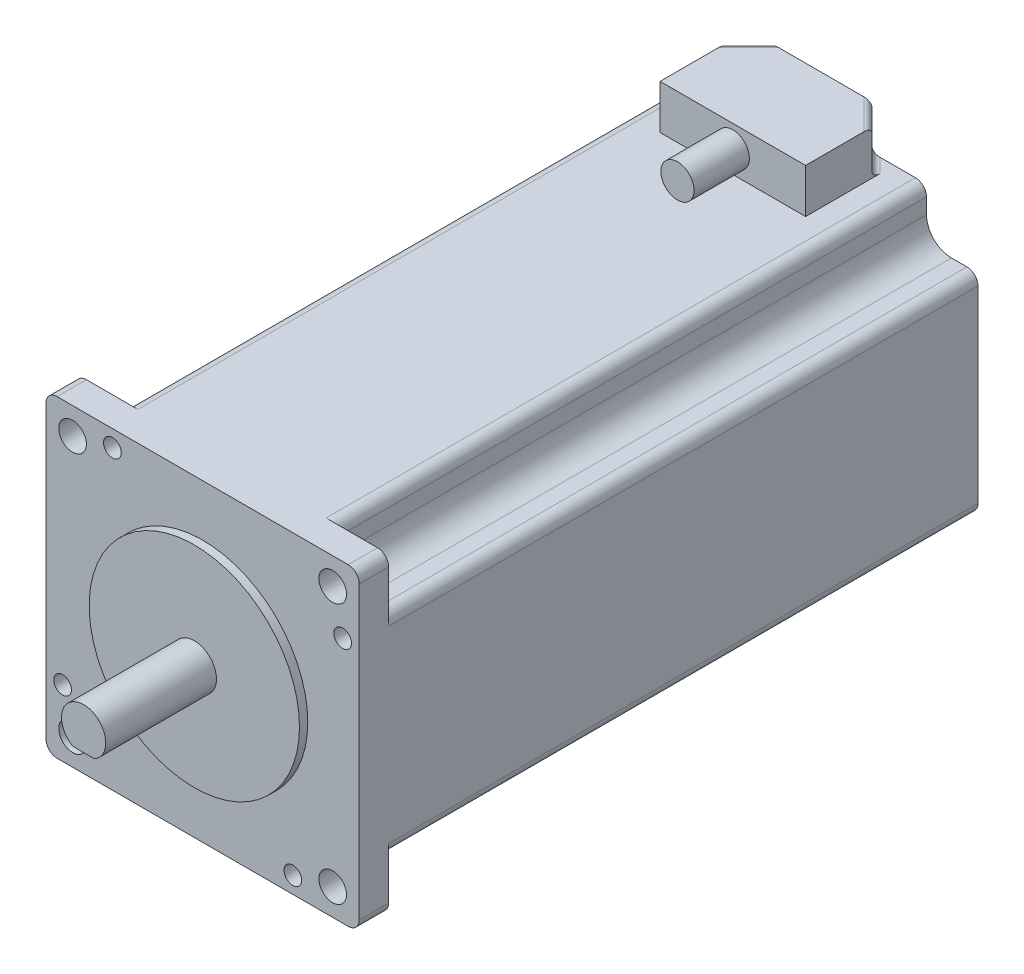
ISO-10303-21;
HEADER;
FILE_DESCRIPTION(('STEP AP214'),'2;1');
FILE_NAME('part.step','',(''),(''),'','','');
FILE_SCHEMA(('AUTOMOTIVE_DESIGN { 1 0 10303 214 1 1 1 1 }'));
ENDSEC;
DATA;
#1=APPLICATION_CONTEXT('core data for automotive mechanical design processes');
#2=APPLICATION_PROTOCOL_DEFINITION('international standard','automotive_design',2000,#1);
#3=PRODUCT_CONTEXT('',#1,'mechanical');
#4=PRODUCT('Part','Part','',(#3));
#5=PRODUCT_RELATED_PRODUCT_CATEGORY('part','',(#4));
#6=PRODUCT_DEFINITION_FORMATION('','',#4);
#7=PRODUCT_DEFINITION_CONTEXT('part definition',#1,'design');
#8=PRODUCT_DEFINITION('design','',#6,#7);
#9=PRODUCT_DEFINITION_SHAPE('','',#8);
#10=(LENGTH_UNIT() NAMED_UNIT(*) SI_UNIT(.MILLI.,.METRE.));
#11=(NAMED_UNIT(*) PLANE_ANGLE_UNIT() SI_UNIT($,.RADIAN.));
#12=(NAMED_UNIT(*) SI_UNIT($,.STERADIAN.) SOLID_ANGLE_UNIT());
#13=UNCERTAINTY_MEASURE_WITH_UNIT(LENGTH_MEASURE(1.E-05),#10,'distance_accuracy_value','');
#14=(GEOMETRIC_REPRESENTATION_CONTEXT(3) GLOBAL_UNCERTAINTY_ASSIGNED_CONTEXT((#13)) GLOBAL_UNIT_ASSIGNED_CONTEXT((#10,
#11,#12)) REPRESENTATION_CONTEXT('',''));
#15=CARTESIAN_POINT('',(0.,0.,0.));
#16=DIRECTION('',(0.,0.,1.));
#17=DIRECTION('',(1.,0.,0.));
#18=AXIS2_PLACEMENT_3D('',#15,#16,#17);
#19=CARTESIAN_POINT('',(0.,0.,-106.5));
#20=DIRECTION('',(0.,0.,-1.));
#21=DIRECTION('',(-1.,0.,0.));
#22=AXIS2_PLACEMENT_3D('',#19,#20,#21);
#23=PLANE('',#22);
#24=CARTESIAN_POINT('',(-25.3,-16.3000000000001,-106.5));
#25=DIRECTION('',(0.,0.,-1.));
#26=DIRECTION('',(0.,-1.,0.));
#27=AXIS2_PLACEMENT_3D('',#24,#25,#26);
#28=CIRCLE('',#27,1.6);
#29=CARTESIAN_POINT('',(-25.2999999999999,-17.9000000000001,-106.5));
#30=VERTEX_POINT('',#29);
#31=EDGE_CURVE('E842',#30,#30,#28,.T.);
#32=ORIENTED_EDGE('',*,*,#31,.F.);
#33=EDGE_LOOP('',(#32));
#34=FACE_BOUND('',#33,.T.);
#35=CARTESIAN_POINT('',(16.3,-25.3,-106.5));
#36=DIRECTION('',(0.,0.,-1.));
#37=DIRECTION('',(1.,0.,0.));
#38=AXIS2_PLACEMENT_3D('',#35,#36,#37);
#39=CIRCLE('',#38,1.6);
#40=CARTESIAN_POINT('',(17.9,-25.3,-106.5));
#41=VERTEX_POINT('',#40);
#42=EDGE_CURVE('E862',#41,#41,#39,.T.);
#43=ORIENTED_EDGE('',*,*,#42,.F.);
#44=EDGE_LOOP('',(#43));
#45=FACE_BOUND('',#44,.T.);
#46=CARTESIAN_POINT('',(25.2999999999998,16.3000000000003,-106.5));
#47=DIRECTION('',(0.,0.,-1.));
#48=DIRECTION('',(0.,1.,0.));
#49=AXIS2_PLACEMENT_3D('',#46,#47,#48);
#50=CIRCLE('',#49,1.6);
#51=CARTESIAN_POINT('',(25.2999999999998,17.9000000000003,-106.5));
#52=VERTEX_POINT('',#51);
#53=EDGE_CURVE('E858',#52,#52,#50,.T.);
#54=ORIENTED_EDGE('',*,*,#53,.F.);
#55=EDGE_LOOP('',(#54));
#56=FACE_BOUND('',#55,.T.);
#57=CARTESIAN_POINT('',(-16.3,25.3,-106.5));
#58=DIRECTION('',(0.,0.,-1.));
#59=DIRECTION('',(-1.,0.,0.));
#60=AXIS2_PLACEMENT_3D('',#57,#58,#59);
#61=CIRCLE('',#60,1.6);
#62=CARTESIAN_POINT('',(-17.9,25.3,-106.5));
#63=VERTEX_POINT('',#62);
#64=EDGE_CURVE('E732',#63,#63,#61,.T.);
#65=ORIENTED_EDGE('',*,*,#64,.F.);
#66=EDGE_LOOP('',(#65));
#67=FACE_BOUND('',#66,.T.);
#68=DIRECTION('',(1.,0.,0.));
#69=VECTOR('',#68,1.);
#70=CARTESIAN_POINT('',(0.,19.0000000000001,-106.5));
#71=LINE('',#70,#69);
#72=CARTESIAN_POINT('',(23.5,19.,-106.5));
#73=VERTEX_POINT('',#72);
#74=CARTESIAN_POINT('',(26.3,19.,-106.5));
#75=VERTEX_POINT('',#74);
#76=EDGE_CURVE('E440',#73,#75,#71,.T.);
#77=ORIENTED_EDGE('',*,*,#76,.T.);
#78=CARTESIAN_POINT('',(26.3,17.,-106.5));
#79=DIRECTION('',(0.,0.,-1.));
#80=DIRECTION('',(-1.,0.,0.));
#81=AXIS2_PLACEMENT_3D('',#78,#79,#80);
#82=CIRCLE('',#81,2.);
#83=CARTESIAN_POINT('',(28.3,17.,-106.5));
#84=VERTEX_POINT('',#83);
#85=EDGE_CURVE('E759',#75,#84,#82,.T.);
#86=ORIENTED_EDGE('',*,*,#85,.T.);
#87=DIRECTION('',(0.,-1.,0.));
#88=VECTOR('',#87,1.);
#89=CARTESIAN_POINT('',(28.3,0.,-106.5));
#90=LINE('',#89,#88);
#91=CARTESIAN_POINT('',(28.3,-17.,-106.5));
#92=VERTEX_POINT('',#91);
#93=EDGE_CURVE('E562',#84,#92,#90,.T.);
#94=ORIENTED_EDGE('',*,*,#93,.T.);
#95=CARTESIAN_POINT('',(26.3,-17.,-106.5));
#96=DIRECTION('',(0.,0.,-1.));
#97=DIRECTION('',(-1.,0.,0.));
#98=AXIS2_PLACEMENT_3D('',#95,#96,#97);
#99=CIRCLE('',#98,2.);
#100=CARTESIAN_POINT('',(26.3,-19.,-106.5));
#101=VERTEX_POINT('',#100);
#102=EDGE_CURVE('E753',#92,#101,#99,.T.);
#103=ORIENTED_EDGE('',*,*,#102,.T.);
#104=DIRECTION('',(1.,0.,0.));
#105=VECTOR('',#104,1.);
#106=CARTESIAN_POINT('',(0.,-19.,-106.5));
#107=LINE('',#106,#105);
#108=CARTESIAN_POINT('',(23.5,-19.,-106.5));
#109=VERTEX_POINT('',#108);
#110=EDGE_CURVE('E399',#109,#101,#107,.T.);
#111=ORIENTED_EDGE('',*,*,#110,.F.);
#112=CARTESIAN_POINT('',(23.5,-23.5,-106.5));
#113=DIRECTION('',(0.,0.,-1.));
#114=DIRECTION('',(-1.,0.,0.));
#115=AXIS2_PLACEMENT_3D('',#112,#113,#114);
#116=CIRCLE('',#115,4.49999999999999);
#117=CARTESIAN_POINT('',(19.,-23.5,-106.5));
#118=VERTEX_POINT('',#117);
#119=EDGE_CURVE('E405',#118,#109,#116,.T.);
#120=ORIENTED_EDGE('',*,*,#119,.F.);
#121=DIRECTION('',(0.,-1.,0.));
#122=VECTOR('',#121,1.);
#123=CARTESIAN_POINT('',(19.,0.,-106.5));
#124=LINE('',#123,#122);
#125=CARTESIAN_POINT('',(19.,-26.3,-106.5));
#126=VERTEX_POINT('',#125);
#127=EDGE_CURVE('E406',#118,#126,#124,.T.);
#128=ORIENTED_EDGE('',*,*,#127,.T.);
#129=CARTESIAN_POINT('',(17.,-26.3,-106.5));
#130=DIRECTION('',(0.,0.,-1.));
#131=DIRECTION('',(-1.,0.,0.));
#132=AXIS2_PLACEMENT_3D('',#129,#130,#131);
#133=CIRCLE('',#132,2.);
#134=CARTESIAN_POINT('',(17.,-28.3,-106.5));
#135=VERTEX_POINT('',#134);
#136=EDGE_CURVE('E754',#126,#135,#133,.T.);
#137=ORIENTED_EDGE('',*,*,#136,.T.);
#138=DIRECTION('',(-1.,0.,0.));
#139=VECTOR('',#138,1.);
#140=CARTESIAN_POINT('',(0.,-28.3,-106.5));
#141=LINE('',#140,#139);
#142=CARTESIAN_POINT('',(-17.,-28.3,-106.5));
#143=VERTEX_POINT('',#142);
#144=EDGE_CURVE('E568',#135,#143,#141,.T.);
#145=ORIENTED_EDGE('',*,*,#144,.T.);
#146=CARTESIAN_POINT('',(-17.,-26.3,-106.5));
#147=DIRECTION('',(0.,0.,-1.));
#148=DIRECTION('',(-1.,0.,0.));
#149=AXIS2_PLACEMENT_3D('',#146,#147,#148);
#150=CIRCLE('',#149,2.);
#151=CARTESIAN_POINT('',(-19.,-26.3,-106.5));
#152=VERTEX_POINT('',#151);
#153=EDGE_CURVE('E746',#143,#152,#150,.T.);
#154=ORIENTED_EDGE('',*,*,#153,.T.);
#155=DIRECTION('',(0.,-1.,0.));
#156=VECTOR('',#155,1.);
#157=CARTESIAN_POINT('',(-19.,0.,-106.5));
#158=LINE('',#157,#156);
#159=CARTESIAN_POINT('',(-19.,-23.5,-106.5));
#160=VERTEX_POINT('',#159);
#161=EDGE_CURVE('E373',#160,#152,#158,.T.);
#162=ORIENTED_EDGE('',*,*,#161,.F.);
#163=CARTESIAN_POINT('',(-23.5,-23.5,-106.5));
#164=DIRECTION('',(0.,0.,-1.));
#165=DIRECTION('',(-1.,0.,0.));
#166=AXIS2_PLACEMENT_3D('',#163,#164,#165);
#167=CIRCLE('',#166,4.49999999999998);
#168=CARTESIAN_POINT('',(-23.5,-19.,-106.5));
#169=VERTEX_POINT('',#168);
#170=EDGE_CURVE('E377',#169,#160,#167,.T.);
#171=ORIENTED_EDGE('',*,*,#170,.F.);
#172=DIRECTION('',(-1.,0.,0.));
#173=VECTOR('',#172,1.);
#174=CARTESIAN_POINT('',(0.,-19.,-106.5));
#175=LINE('',#174,#173);
#176=CARTESIAN_POINT('',(-26.3,-19.,-106.5));
#177=VERTEX_POINT('',#176);
#178=EDGE_CURVE('E370',#169,#177,#175,.T.);
#179=ORIENTED_EDGE('',*,*,#178,.T.);
#180=CARTESIAN_POINT('',(-26.3,-17.,-106.5));
#181=DIRECTION('',(0.,0.,-1.));
#182=DIRECTION('',(-1.,0.,0.));
#183=AXIS2_PLACEMENT_3D('',#180,#181,#182);
#184=CIRCLE('',#183,2.);
#185=CARTESIAN_POINT('',(-28.3,-17.,-106.5));
#186=VERTEX_POINT('',#185);
#187=EDGE_CURVE('E741',#177,#186,#184,.T.);
#188=ORIENTED_EDGE('',*,*,#187,.T.);
#189=DIRECTION('',(0.,1.,0.));
#190=VECTOR('',#189,1.);
#191=CARTESIAN_POINT('',(-28.3,0.,-106.5));
#192=LINE('',#191,#190);
#193=CARTESIAN_POINT('',(-28.3,17.,-106.5));
#194=VERTEX_POINT('',#193);
#195=EDGE_CURVE('E575',#186,#194,#192,.T.);
#196=ORIENTED_EDGE('',*,*,#195,.T.);
#197=CARTESIAN_POINT('',(-26.3,17.,-106.5));
#198=DIRECTION('',(0.,0.,-1.));
#199=DIRECTION('',(-1.,0.,0.));
#200=AXIS2_PLACEMENT_3D('',#197,#198,#199);
#201=CIRCLE('',#200,2.);
#202=CARTESIAN_POINT('',(-26.3,19.,-106.5));
#203=VERTEX_POINT('',#202);
#204=EDGE_CURVE('E744',#194,#203,#201,.T.);
#205=ORIENTED_EDGE('',*,*,#204,.T.);
#206=DIRECTION('',(-1.,0.,0.));
#207=VECTOR('',#206,1.);
#208=CARTESIAN_POINT('',(0.,19.,-106.5));
#209=LINE('',#208,#207);
#210=CARTESIAN_POINT('',(-23.5,19.,-106.5));
#211=VERTEX_POINT('',#210);
#212=EDGE_CURVE('E355',#211,#203,#209,.T.);
#213=ORIENTED_EDGE('',*,*,#212,.F.);
#214=CARTESIAN_POINT('',(-23.5,23.5,-106.5));
#215=DIRECTION('',(0.,0.,-1.));
#216=DIRECTION('',(-1.,0.,0.));
#217=AXIS2_PLACEMENT_3D('',#214,#215,#216);
#218=CIRCLE('',#217,4.49999999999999);
#219=CARTESIAN_POINT('',(-19.,23.5,-106.5));
#220=VERTEX_POINT('',#219);
#221=EDGE_CURVE('E342',#220,#211,#218,.T.);
#222=ORIENTED_EDGE('',*,*,#221,.F.);
#223=DIRECTION('',(0.,1.,0.));
#224=VECTOR('',#223,1.);
#225=CARTESIAN_POINT('',(-19.0000000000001,0.,-106.5));
#226=LINE('',#225,#224);
#227=CARTESIAN_POINT('',(-19.,26.3,-106.5));
#228=VERTEX_POINT('',#227);
#229=EDGE_CURVE('E359',#220,#228,#226,.T.);
#230=ORIENTED_EDGE('',*,*,#229,.T.);
#231=CARTESIAN_POINT('',(-17.,26.3,-106.5));
#232=DIRECTION('',(0.,0.,-1.));
#233=DIRECTION('',(-1.,0.,0.));
#234=AXIS2_PLACEMENT_3D('',#231,#232,#233);
#235=CIRCLE('',#234,2.);
#236=CARTESIAN_POINT('',(-17.,28.3,-106.5));
#237=VERTEX_POINT('',#236);
#238=EDGE_CURVE('E739',#228,#237,#235,.T.);
#239=ORIENTED_EDGE('',*,*,#238,.T.);
#240=DIRECTION('',(1.,0.,0.));
#241=VECTOR('',#240,1.);
#242=CARTESIAN_POINT('',(0.,28.3,-106.5));
#243=LINE('',#242,#241);
#244=CARTESIAN_POINT('',(-10.5642135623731,28.3,-106.5));
#245=VERTEX_POINT('',#244);
#246=EDGE_CURVE('E561',#237,#245,#243,.T.);
#247=ORIENTED_EDGE('',*,*,#246,.T.);
#248=CARTESIAN_POINT('',(-10.5642135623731,29.3,-106.5));
#249=DIRECTION('',(0.,0.,-1.));
#250=DIRECTION('',(1.,0.,0.));
#251=AXIS2_PLACEMENT_3D('',#248,#249,#250);
#252=ELLIPSE('',#251,1.4142135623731,1.);
#253=CARTESIAN_POINT('',(-9.14999999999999,29.3,-106.5));
#254=VERTEX_POINT('',#253);
#255=EDGE_CURVE('E725',#245,#254,#252,.F.);
#256=ORIENTED_EDGE('',*,*,#255,.T.);
#257=DIRECTION('',(0.,1.,0.));
#258=VECTOR('',#257,1.);
#259=CARTESIAN_POINT('',(-9.14999999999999,36.3,-106.5));
#260=LINE('',#259,#258);
#261=CARTESIAN_POINT('',(-9.14999999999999,35.3,-106.5));
#262=VERTEX_POINT('',#261);
#263=EDGE_CURVE('E657',#254,#262,#260,.T.);
#264=ORIENTED_EDGE('',*,*,#263,.T.);
#265=CARTESIAN_POINT('',(-7.73578643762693,35.3,-106.5));
#266=DIRECTION('',(0.,0.,-1.));
#267=DIRECTION('',(-1.,0.,0.));
#268=AXIS2_PLACEMENT_3D('',#265,#266,#267);
#269=ELLIPSE('',#268,1.4142135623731,1.);
#270=CARTESIAN_POINT('',(-7.73578643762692,36.3,-106.5));
#271=VERTEX_POINT('',#270);
#272=EDGE_CURVE('E699',#262,#271,#269,.T.);
#273=ORIENTED_EDGE('',*,*,#272,.T.);
#274=DIRECTION('',(-1.,0.,0.));
#275=VECTOR('',#274,1.);
#276=CARTESIAN_POINT('',(-13.15,36.3,-106.5));
#277=LINE('',#276,#275);
#278=CARTESIAN_POINT('',(7.73578643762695,36.3,-106.5));
#279=VERTEX_POINT('',#278);
#280=EDGE_CURVE('E475',#279,#271,#277,.T.);
#281=ORIENTED_EDGE('',*,*,#280,.F.);
#282=CARTESIAN_POINT('',(7.73578643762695,35.3,-106.5));
#283=DIRECTION('',(0.,0.,-1.));
#284=DIRECTION('',(-1.,0.,0.));
#285=AXIS2_PLACEMENT_3D('',#282,#283,#284);
#286=ELLIPSE('',#285,1.41421356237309,1.);
#287=CARTESIAN_POINT('',(9.15000000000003,35.3,-106.5));
#288=VERTEX_POINT('',#287);
#289=EDGE_CURVE('E702',#279,#288,#286,.T.);
#290=ORIENTED_EDGE('',*,*,#289,.T.);
#291=DIRECTION('',(0.,-1.,0.));
#292=VECTOR('',#291,1.);
#293=CARTESIAN_POINT('',(9.15000000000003,28.3,-106.5));
#294=LINE('',#293,#292);
#295=CARTESIAN_POINT('',(9.15000000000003,29.3,-106.5));
#296=VERTEX_POINT('',#295);
#297=EDGE_CURVE('E665',#288,#296,#294,.T.);
#298=ORIENTED_EDGE('',*,*,#297,.T.);
#299=CARTESIAN_POINT('',(10.5642135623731,29.3,-106.5));
#300=DIRECTION('',(0.,0.,-1.));
#301=DIRECTION('',(1.,0.,0.));
#302=AXIS2_PLACEMENT_3D('',#299,#300,#301);
#303=ELLIPSE('',#302,1.41421356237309,1.);
#304=CARTESIAN_POINT('',(10.5642135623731,28.3,-106.5));
#305=VERTEX_POINT('',#304);
#306=EDGE_CURVE('E723',#296,#305,#303,.F.);
#307=ORIENTED_EDGE('',*,*,#306,.T.);
#308=CARTESIAN_POINT('',(17.,28.3,-106.5));
#309=VERTEX_POINT('',#308);
#310=EDGE_CURVE('E558',#305,#309,#243,.T.);
#311=ORIENTED_EDGE('',*,*,#310,.T.);
#312=CARTESIAN_POINT('',(17.,26.3,-106.5));
#313=DIRECTION('',(0.,0.,-1.));
#314=DIRECTION('',(-1.,0.,0.));
#315=AXIS2_PLACEMENT_3D('',#312,#313,#314);
#316=CIRCLE('',#315,2.);
#317=CARTESIAN_POINT('',(19.,26.3,-106.5));
#318=VERTEX_POINT('',#317);
#319=EDGE_CURVE('E760',#309,#318,#316,.T.);
#320=ORIENTED_EDGE('',*,*,#319,.T.);
#321=DIRECTION('',(0.,1.,0.));
#322=VECTOR('',#321,1.);
#323=CARTESIAN_POINT('',(19.,0.,-106.5));
#324=LINE('',#323,#322);
#325=CARTESIAN_POINT('',(19.,23.5,-106.5));
#326=VERTEX_POINT('',#325);
#327=EDGE_CURVE('E430',#326,#318,#324,.T.);
#328=ORIENTED_EDGE('',*,*,#327,.F.);
#329=CARTESIAN_POINT('',(23.5,23.5,-106.5));
#330=DIRECTION('',(0.,0.,-1.));
#331=DIRECTION('',(-1.,0.,0.));
#332=AXIS2_PLACEMENT_3D('',#329,#330,#331);
#333=CIRCLE('',#332,4.49999999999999);
#334=EDGE_CURVE('E435',#73,#326,#333,.T.);
#335=ORIENTED_EDGE('',*,*,#334,.F.);
#336=EDGE_LOOP('',(#77,#86,#94,#103,#111,#120,#128,#137,#145,#154,#162,#171,#179,#188,#196,#205,
#213,#222,#230,#239,#247,#256,#264,#273,#281,#290,#298,#307,#311,#320,#328,#335));
#337=FACE_BOUND('',#336,.T.);
#338=ADVANCED_FACE('F47',(#34,#45,#56,#67,#337),#23,.T.);
#339=CARTESIAN_POINT('',(-28.3,28.3,5.3));
#340=DIRECTION('',(0.,-1.,0.));
#341=DIRECTION('',(0.,0.,-1.));
#342=AXIS2_PLACEMENT_3D('',#339,#340,#341);
#343=PLANE('',#342);
#344=DIRECTION('',(-1.,0.,0.));
#345=VECTOR('',#344,1.);
#346=CARTESIAN_POINT('',(-28.3,28.3,0.));
#347=LINE('',#346,#345);
#348=CARTESIAN_POINT('',(26.3,28.3,0.));
#349=VERTEX_POINT('',#348);
#350=CARTESIAN_POINT('',(17.,28.3,0.));
#351=VERTEX_POINT('',#350);
#352=EDGE_CURVE('E600',#349,#351,#347,.T.);
#353=ORIENTED_EDGE('',*,*,#352,.T.);
#354=DIRECTION('',(0.,0.,-1.));
#355=VECTOR('',#354,1.);
#356=CARTESIAN_POINT('',(17.,28.3,5.3));
#357=LINE('',#356,#355);
#358=EDGE_CURVE('E773',#351,#309,#357,.T.);
#359=ORIENTED_EDGE('',*,*,#358,.T.);
#360=ORIENTED_EDGE('',*,*,#310,.F.);
#361=DIRECTION('',(0.707106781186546,0.,0.707106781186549));
#362=VECTOR('',#361,1.);
#363=CARTESIAN_POINT('',(47.0321067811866,28.3,-70.0321067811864));
#364=LINE('',#363,#362);
#365=CARTESIAN_POINT('',(13.15,28.3,-103.914213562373));
#366=VERTEX_POINT('',#365);
#367=EDGE_CURVE('E682',#305,#366,#364,.T.);
#368=ORIENTED_EDGE('',*,*,#367,.T.);
#369=DIRECTION('',(0.,0.,-1.));
#370=VECTOR('',#369,1.);
#371=CARTESIAN_POINT('',(13.15,28.3,-106.5));
#372=LINE('',#371,#370);
#373=CARTESIAN_POINT('',(13.15,28.3,-90.5));
#374=VERTEX_POINT('',#373);
#375=EDGE_CURVE('E467',#374,#366,#372,.T.);
#376=ORIENTED_EDGE('',*,*,#375,.F.);
#377=DIRECTION('',(1.,0.,0.));
#378=VECTOR('',#377,1.);
#379=CARTESIAN_POINT('',(-13.15,28.3,-90.5));
#380=LINE('',#379,#378);
#381=CARTESIAN_POINT('',(-13.15,28.3,-90.5));
#382=VERTEX_POINT('',#381);
#383=EDGE_CURVE('E477',#382,#374,#380,.T.);
#384=ORIENTED_EDGE('',*,*,#383,.F.);
#385=DIRECTION('',(0.,0.,1.));
#386=VECTOR('',#385,1.);
#387=CARTESIAN_POINT('',(-13.15,28.3,-106.5));
#388=LINE('',#387,#386);
#389=CARTESIAN_POINT('',(-13.15,28.3,-103.914213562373));
#390=VERTEX_POINT('',#389);
#391=EDGE_CURVE('E463',#390,#382,#388,.T.);
#392=ORIENTED_EDGE('',*,*,#391,.F.);
#393=DIRECTION('',(0.707106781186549,0.,-0.707106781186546));
#394=VECTOR('',#393,1.);
#395=CARTESIAN_POINT('',(-75.3321067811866,28.3,-41.7321067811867));
#396=LINE('',#395,#394);
#397=EDGE_CURVE('E677',#390,#245,#396,.T.);
#398=ORIENTED_EDGE('',*,*,#397,.T.);
#399=ORIENTED_EDGE('',*,*,#246,.F.);
#400=DIRECTION('',(0.,0.,-1.));
#401=VECTOR('',#400,1.);
#402=CARTESIAN_POINT('',(-17.,28.3,0.));
#403=LINE('',#402,#401);
#404=CARTESIAN_POINT('',(-17.,28.3,0.));
#405=VERTEX_POINT('',#404);
#406=EDGE_CURVE('E772',#237,#405,#403,.F.);
#407=ORIENTED_EDGE('',*,*,#406,.T.);
#408=CARTESIAN_POINT('',(-26.3,28.3,0.));
#409=VERTEX_POINT('',#408);
#410=EDGE_CURVE('E597',#405,#409,#347,.T.);
#411=ORIENTED_EDGE('',*,*,#410,.T.);
#412=DIRECTION('',(0.,0.,-1.));
#413=VECTOR('',#412,1.);
#414=CARTESIAN_POINT('',(-26.3,28.3,5.3));
#415=LINE('',#414,#413);
#416=CARTESIAN_POINT('',(-26.3,28.3,5.3));
#417=VERTEX_POINT('',#416);
#418=EDGE_CURVE('E645',#409,#417,#415,.F.);
#419=ORIENTED_EDGE('',*,*,#418,.T.);
#420=DIRECTION('',(-1.,0.,0.));
#421=VECTOR('',#420,1.);
#422=CARTESIAN_POINT('',(-28.3,28.3,5.3));
#423=LINE('',#422,#421);
#424=CARTESIAN_POINT('',(26.3,28.3,5.3));
#425=VERTEX_POINT('',#424);
#426=EDGE_CURVE('E584',#425,#417,#423,.T.);
#427=ORIENTED_EDGE('',*,*,#426,.F.);
#428=DIRECTION('',(0.,0.,-1.));
#429=VECTOR('',#428,1.);
#430=CARTESIAN_POINT('',(26.3,28.3,5.3));
#431=LINE('',#430,#429);
#432=EDGE_CURVE('E637',#425,#349,#431,.T.);
#433=ORIENTED_EDGE('',*,*,#432,.T.);
#434=EDGE_LOOP('',(#353,#359,#360,#368,#376,#384,#392,#398,#399,#407,#411,#419,#427,#433));
#435=FACE_BOUND('',#434,.T.);
#436=ADVANCED_FACE('F877',(#435),#343,.F.);
#437=CARTESIAN_POINT('',(0.,0.,26.8));
#438=DIRECTION('',(0.,0.,-1.));
#439=DIRECTION('',(-1.,0.,0.));
#440=AXIS2_PLACEMENT_3D('',#437,#438,#439);
#441=CYLINDRICAL_SURFACE('',#440,4.);
#442=CARTESIAN_POINT('',(0.,0.,6.8));
#443=DIRECTION('',(0.,0.,1.));
#444=DIRECTION('',(1.,0.,0.));
#445=AXIS2_PLACEMENT_3D('',#442,#443,#444);
#446=CIRCLE('',#445,4.);
#447=CARTESIAN_POINT('',(4.,0.,6.8));
#448=VERTEX_POINT('',#447);
#449=EDGE_CURVE('E549',#448,#448,#446,.T.);
#450=ORIENTED_EDGE('',*,*,#449,.T.);
#451=EDGE_LOOP('',(#450));
#452=FACE_BOUND('',#451,.T.);
#453=DIRECTION('',(0.,0.,1.));
#454=VECTOR('',#453,1.);
#455=CARTESIAN_POINT('',(-1.93649167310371,-3.5,8.8));
#456=LINE('',#455,#454);
#457=CARTESIAN_POINT('',(-1.93649167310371,-3.5,8.8));
#458=VERTEX_POINT('',#457);
#459=CARTESIAN_POINT('',(-1.93649167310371,-3.5,26.8));
#460=VERTEX_POINT('',#459);
#461=EDGE_CURVE('E535',#458,#460,#456,.T.);
#462=ORIENTED_EDGE('',*,*,#461,.T.);
#463=CARTESIAN_POINT('',(0.,0.,26.8));
#464=DIRECTION('',(0.,0.,1.));
#465=DIRECTION('',(1.,0.,0.));
#466=AXIS2_PLACEMENT_3D('',#463,#464,#465);
#467=CIRCLE('',#466,4.);
#468=CARTESIAN_POINT('',(1.93649167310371,-3.5,26.8));
#469=VERTEX_POINT('',#468);
#470=EDGE_CURVE('E538',#469,#460,#467,.T.);
#471=ORIENTED_EDGE('',*,*,#470,.F.);
#472=DIRECTION('',(0.,0.,1.));
#473=VECTOR('',#472,1.);
#474=CARTESIAN_POINT('',(1.93649167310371,-3.5,8.8));
#475=LINE('',#474,#473);
#476=CARTESIAN_POINT('',(1.93649167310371,-3.5,8.8));
#477=VERTEX_POINT('',#476);
#478=EDGE_CURVE('E539',#477,#469,#475,.T.);
#479=ORIENTED_EDGE('',*,*,#478,.F.);
#480=CARTESIAN_POINT('',(0.,0.,8.8));
#481=DIRECTION('',(0.,0.,1.));
#482=DIRECTION('',(1.,0.,0.));
#483=AXIS2_PLACEMENT_3D('',#480,#481,#482);
#484=CIRCLE('',#483,4.);
#485=EDGE_CURVE('E527',#458,#477,#484,.T.);
#486=ORIENTED_EDGE('',*,*,#485,.F.);
#487=EDGE_LOOP('',(#462,#471,#479,#486));
#488=FACE_BOUND('',#487,.T.);
#489=ADVANCED_FACE('F1171',(#452,#488),#441,.T.);
#490=CARTESIAN_POINT('',(0.,0.,26.8));
#491=DIRECTION('',(0.,0.,1.));
#492=DIRECTION('',(1.,0.,0.));
#493=AXIS2_PLACEMENT_3D('',#490,#491,#492);
#494=PLANE('',#493);
#495=ORIENTED_EDGE('',*,*,#470,.T.);
#496=DIRECTION('',(1.,0.,0.));
#497=VECTOR('',#496,1.);
#498=CARTESIAN_POINT('',(0.,-3.5,26.8));
#499=LINE('',#498,#497);
#500=EDGE_CURVE('E524',#460,#469,#499,.T.);
#501=ORIENTED_EDGE('',*,*,#500,.T.);
#502=EDGE_LOOP('',(#495,#501));
#503=FACE_BOUND('',#502,.T.);
#504=ADVANCED_FACE('F1167',(#503),#494,.T.);
#505=CARTESIAN_POINT('',(0.,0.,0.));
#506=DIRECTION('',(0.,0.,1.));
#507=DIRECTION('',(1.,0.,0.));
#508=AXIS2_PLACEMENT_3D('',#505,#506,#507);
#509=PLANE('',#508);
#510=DIRECTION('',(-1.,0.,0.));
#511=VECTOR('',#510,1.);
#512=CARTESIAN_POINT('',(0.,19.,0.));
#513=LINE('',#512,#511);
#514=CARTESIAN_POINT('',(-23.5,19.,0.));
#515=VERTEX_POINT('',#514);
#516=CARTESIAN_POINT('',(-26.3,19.,0.));
#517=VERTEX_POINT('',#516);
#518=EDGE_CURVE('E327',#515,#517,#513,.T.);
#519=ORIENTED_EDGE('',*,*,#518,.T.);
#520=CARTESIAN_POINT('',(-26.3,17.,0.));
#521=DIRECTION('',(0.,0.,1.));
#522=DIRECTION('',(1.,0.,0.));
#523=AXIS2_PLACEMENT_3D('',#520,#521,#522);
#524=CIRCLE('',#523,2.);
#525=CARTESIAN_POINT('',(-28.3,17.,0.));
#526=VERTEX_POINT('',#525);
#527=EDGE_CURVE('E56',#517,#526,#524,.T.);
#528=ORIENTED_EDGE('',*,*,#527,.T.);
#529=DIRECTION('',(0.,-1.,0.));
#530=VECTOR('',#529,1.);
#531=CARTESIAN_POINT('',(-28.3,28.3,0.));
#532=LINE('',#531,#530);
#533=CARTESIAN_POINT('',(-28.3,26.3,0.));
#534=VERTEX_POINT('',#533);
#535=EDGE_CURVE('E604',#534,#526,#532,.T.);
#536=ORIENTED_EDGE('',*,*,#535,.F.);
#537=CARTESIAN_POINT('',(-26.3,26.3,0.));
#538=DIRECTION('',(0.,0.,1.));
#539=DIRECTION('',(1.,0.,0.));
#540=AXIS2_PLACEMENT_3D('',#537,#538,#539);
#541=CIRCLE('',#540,2.);
#542=EDGE_CURVE('E634',#534,#409,#541,.F.);
#543=ORIENTED_EDGE('',*,*,#542,.T.);
#544=ORIENTED_EDGE('',*,*,#410,.F.);
#545=CARTESIAN_POINT('',(-17.,26.3,0.));
#546=DIRECTION('',(0.,0.,1.));
#547=DIRECTION('',(1.,0.,0.));
#548=AXIS2_PLACEMENT_3D('',#545,#546,#547);
#549=CIRCLE('',#548,2.);
#550=CARTESIAN_POINT('',(-19.,26.3,0.));
#551=VERTEX_POINT('',#550);
#552=EDGE_CURVE('E11',#405,#551,#549,.T.);
#553=ORIENTED_EDGE('',*,*,#552,.T.);
#554=DIRECTION('',(0.,1.,0.));
#555=VECTOR('',#554,1.);
#556=CARTESIAN_POINT('',(-19.0000000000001,0.,0.));
#557=LINE('',#556,#555);
#558=CARTESIAN_POINT('',(-19.,23.5,0.));
#559=VERTEX_POINT('',#558);
#560=EDGE_CURVE('E353',#559,#551,#557,.T.);
#561=ORIENTED_EDGE('',*,*,#560,.F.);
#562=CARTESIAN_POINT('',(-23.5,23.5,0.));
#563=DIRECTION('',(0.,0.,1.));
#564=DIRECTION('',(1.,0.,0.));
#565=AXIS2_PLACEMENT_3D('',#562,#563,#564);
#566=CIRCLE('',#565,4.49999999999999);
#567=EDGE_CURVE('E345',#559,#515,#566,.F.);
#568=ORIENTED_EDGE('',*,*,#567,.T.);
#569=EDGE_LOOP('',(#519,#528,#536,#543,#544,#553,#561,#568));
#570=FACE_BOUND('',#569,.T.);
#571=CARTESIAN_POINT('',(-23.5,23.5,0.));
#572=DIRECTION('',(0.,0.,1.));
#573=DIRECTION('',(1.,0.,0.));
#574=AXIS2_PLACEMENT_3D('',#571,#572,#573);
#575=CIRCLE('',#574,2.5);
#576=CARTESIAN_POINT('',(-21.,23.5,0.));
#577=VERTEX_POINT('',#576);
#578=EDGE_CURVE('E517',#577,#577,#575,.T.);
#579=ORIENTED_EDGE('',*,*,#578,.T.);
#580=EDGE_LOOP('',(#579));
#581=FACE_BOUND('',#580,.T.);
#582=ADVANCED_FACE('F349',(#570,#581),#509,.F.);
#583=DIRECTION('',(0.,-1.,0.));
#584=VECTOR('',#583,1.);
#585=CARTESIAN_POINT('',(-19.,0.,0.));
#586=LINE('',#585,#584);
#587=CARTESIAN_POINT('',(-19.,-23.5,0.));
#588=VERTEX_POINT('',#587);
#589=CARTESIAN_POINT('',(-19.,-26.3,0.));
#590=VERTEX_POINT('',#589);
#591=EDGE_CURVE('E380',#588,#590,#586,.T.);
#592=ORIENTED_EDGE('',*,*,#591,.T.);
#593=CARTESIAN_POINT('',(-17.,-26.3,0.));
#594=DIRECTION('',(0.,0.,1.));
#595=DIRECTION('',(1.,0.,0.));
#596=AXIS2_PLACEMENT_3D('',#593,#594,#595);
#597=CIRCLE('',#596,2.);
#598=CARTESIAN_POINT('',(-17.,-28.3,0.));
#599=VERTEX_POINT('',#598);
#600=EDGE_CURVE('E835',#590,#599,#597,.T.);
#601=ORIENTED_EDGE('',*,*,#600,.T.);
#602=DIRECTION('',(1.,0.,0.));
#603=VECTOR('',#602,1.);
#604=CARTESIAN_POINT('',(-28.3,-28.3,0.));
#605=LINE('',#604,#603);
#606=CARTESIAN_POINT('',(-26.3,-28.3,0.));
#607=VERTEX_POINT('',#606);
#608=EDGE_CURVE('E581',#607,#599,#605,.T.);
#609=ORIENTED_EDGE('',*,*,#608,.F.);
#610=CARTESIAN_POINT('',(-26.3,-26.3,0.));
#611=DIRECTION('',(0.,0.,1.));
#612=DIRECTION('',(1.,0.,0.));
#613=AXIS2_PLACEMENT_3D('',#610,#611,#612);
#614=CIRCLE('',#613,2.);
#615=CARTESIAN_POINT('',(-28.3,-26.3,0.));
#616=VERTEX_POINT('',#615);
#617=EDGE_CURVE('E612',#607,#616,#614,.F.);
#618=ORIENTED_EDGE('',*,*,#617,.T.);
#619=CARTESIAN_POINT('',(-28.3,-17.,0.));
#620=VERTEX_POINT('',#619);
#621=EDGE_CURVE('E598',#620,#616,#532,.T.);
#622=ORIENTED_EDGE('',*,*,#621,.F.);
#623=CARTESIAN_POINT('',(-26.3,-17.,0.));
#624=DIRECTION('',(0.,0.,1.));
#625=DIRECTION('',(1.,0.,0.));
#626=AXIS2_PLACEMENT_3D('',#623,#624,#625);
#627=CIRCLE('',#626,2.);
#628=CARTESIAN_POINT('',(-26.3,-19.,0.));
#629=VERTEX_POINT('',#628);
#630=EDGE_CURVE('E837',#620,#629,#627,.T.);
#631=ORIENTED_EDGE('',*,*,#630,.T.);
#632=DIRECTION('',(-1.,0.,0.));
#633=VECTOR('',#632,1.);
#634=CARTESIAN_POINT('',(0.,-19.,0.));
#635=LINE('',#634,#633);
#636=CARTESIAN_POINT('',(-23.5,-19.,0.));
#637=VERTEX_POINT('',#636);
#638=EDGE_CURVE('E385',#637,#629,#635,.T.);
#639=ORIENTED_EDGE('',*,*,#638,.F.);
#640=CARTESIAN_POINT('',(-23.5,-23.5,0.));
#641=DIRECTION('',(0.,0.,1.));
#642=DIRECTION('',(1.,0.,0.));
#643=AXIS2_PLACEMENT_3D('',#640,#641,#642);
#644=CIRCLE('',#643,4.49999999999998);
#645=EDGE_CURVE('E371',#637,#588,#644,.F.);
#646=ORIENTED_EDGE('',*,*,#645,.T.);
#647=EDGE_LOOP('',(#592,#601,#609,#618,#622,#631,#639,#646));
#648=FACE_BOUND('',#647,.T.);
#649=CARTESIAN_POINT('',(-23.5,-23.5,0.));
#650=DIRECTION('',(0.,0.,1.));
#651=DIRECTION('',(1.,0.,0.));
#652=AXIS2_PLACEMENT_3D('',#649,#650,#651);
#653=CIRCLE('',#652,2.5);
#654=CARTESIAN_POINT('',(-21.,-23.5,0.));
#655=VERTEX_POINT('',#654);
#656=EDGE_CURVE('E507',#655,#655,#653,.T.);
#657=ORIENTED_EDGE('',*,*,#656,.T.);
#658=EDGE_LOOP('',(#657));
#659=FACE_BOUND('',#658,.T.);
#660=ADVANCED_FACE('F945',(#648,#659),#509,.F.);
#661=DIRECTION('',(1.,0.,0.));
#662=VECTOR('',#661,1.);
#663=CARTESIAN_POINT('',(0.,-19.,0.));
#664=LINE('',#663,#662);
#665=CARTESIAN_POINT('',(23.5,-19.,0.));
#666=VERTEX_POINT('',#665);
#667=CARTESIAN_POINT('',(26.3,-19.,0.));
#668=VERTEX_POINT('',#667);
#669=EDGE_CURVE('E395',#666,#668,#664,.T.);
#670=ORIENTED_EDGE('',*,*,#669,.T.);
#671=CARTESIAN_POINT('',(26.3,-17.,0.));
#672=DIRECTION('',(0.,0.,1.));
#673=DIRECTION('',(1.,0.,0.));
#674=AXIS2_PLACEMENT_3D('',#671,#672,#673);
#675=CIRCLE('',#674,2.);
#676=CARTESIAN_POINT('',(28.3,-17.,0.));
#677=VERTEX_POINT('',#676);
#678=EDGE_CURVE('E828',#668,#677,#675,.T.);
#679=ORIENTED_EDGE('',*,*,#678,.T.);
#680=DIRECTION('',(0.,1.,0.));
#681=VECTOR('',#680,1.);
#682=CARTESIAN_POINT('',(28.3,28.3,0.));
#683=LINE('',#682,#681);
#684=CARTESIAN_POINT('',(28.3,-26.3,0.));
#685=VERTEX_POINT('',#684);
#686=EDGE_CURVE('E592',#685,#677,#683,.T.);
#687=ORIENTED_EDGE('',*,*,#686,.F.);
#688=CARTESIAN_POINT('',(26.3,-26.3,0.));
#689=DIRECTION('',(0.,0.,1.));
#690=DIRECTION('',(1.,0.,0.));
#691=AXIS2_PLACEMENT_3D('',#688,#689,#690);
#692=CIRCLE('',#691,2.);
#693=CARTESIAN_POINT('',(26.3,-28.3,0.));
#694=VERTEX_POINT('',#693);
#695=EDGE_CURVE('E655',#685,#694,#692,.F.);
#696=ORIENTED_EDGE('',*,*,#695,.T.);
#697=CARTESIAN_POINT('',(17.,-28.3,0.));
#698=VERTEX_POINT('',#697);
#699=EDGE_CURVE('E603',#698,#694,#605,.T.);
#700=ORIENTED_EDGE('',*,*,#699,.F.);
#701=CARTESIAN_POINT('',(17.,-26.3,0.));
#702=DIRECTION('',(0.,0.,1.));
#703=DIRECTION('',(1.,0.,0.));
#704=AXIS2_PLACEMENT_3D('',#701,#702,#703);
#705=CIRCLE('',#704,2.);
#706=CARTESIAN_POINT('',(19.,-26.3,0.));
#707=VERTEX_POINT('',#706);
#708=EDGE_CURVE('E824',#698,#707,#705,.T.);
#709=ORIENTED_EDGE('',*,*,#708,.T.);
#710=DIRECTION('',(0.,-1.,0.));
#711=VECTOR('',#710,1.);
#712=CARTESIAN_POINT('',(19.,0.,0.));
#713=LINE('',#712,#711);
#714=CARTESIAN_POINT('',(19.,-23.5,0.));
#715=VERTEX_POINT('',#714);
#716=EDGE_CURVE('E409',#715,#707,#713,.T.);
#717=ORIENTED_EDGE('',*,*,#716,.F.);
#718=CARTESIAN_POINT('',(23.5,-23.5,0.));
#719=DIRECTION('',(0.,0.,1.));
#720=DIRECTION('',(1.,0.,0.));
#721=AXIS2_PLACEMENT_3D('',#718,#719,#720);
#722=CIRCLE('',#721,4.49999999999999);
#723=EDGE_CURVE('E413',#715,#666,#722,.F.);
#724=ORIENTED_EDGE('',*,*,#723,.T.);
#725=EDGE_LOOP('',(#670,#679,#687,#696,#700,#709,#717,#724));
#726=FACE_BOUND('',#725,.T.);
#727=CARTESIAN_POINT('',(23.5,-23.5,0.));
#728=DIRECTION('',(0.,0.,1.));
#729=DIRECTION('',(1.,0.,0.));
#730=AXIS2_PLACEMENT_3D('',#727,#728,#729);
#731=CIRCLE('',#730,2.5);
#732=CARTESIAN_POINT('',(26.,-23.5,0.));
#733=VERTEX_POINT('',#732);
#734=EDGE_CURVE('E515',#733,#733,#731,.T.);
#735=ORIENTED_EDGE('',*,*,#734,.T.);
#736=EDGE_LOOP('',(#735));
#737=FACE_BOUND('',#736,.T.);
#738=ADVANCED_FACE('F911',(#726,#737),#509,.F.);
#739=DIRECTION('',(0.,1.,0.));
#740=VECTOR('',#739,1.);
#741=CARTESIAN_POINT('',(19.,0.,0.));
#742=LINE('',#741,#740);
#743=CARTESIAN_POINT('',(19.,23.5,0.));
#744=VERTEX_POINT('',#743);
#745=CARTESIAN_POINT('',(19.,26.3,0.));
#746=VERTEX_POINT('',#745);
#747=EDGE_CURVE('E448',#744,#746,#742,.T.);
#748=ORIENTED_EDGE('',*,*,#747,.T.);
#749=CARTESIAN_POINT('',(17.,26.3,0.));
#750=DIRECTION('',(0.,0.,1.));
#751=DIRECTION('',(1.,0.,0.));
#752=AXIS2_PLACEMENT_3D('',#749,#750,#751);
#753=CIRCLE('',#752,2.);
#754=EDGE_CURVE('E821',#746,#351,#753,.T.);
#755=ORIENTED_EDGE('',*,*,#754,.T.);
#756=ORIENTED_EDGE('',*,*,#352,.F.);
#757=CARTESIAN_POINT('',(26.3,26.3,0.));
#758=DIRECTION('',(0.,0.,1.));
#759=DIRECTION('',(1.,0.,0.));
#760=AXIS2_PLACEMENT_3D('',#757,#758,#759);
#761=CIRCLE('',#760,2.);
#762=CARTESIAN_POINT('',(28.3,26.3,0.));
#763=VERTEX_POINT('',#762);
#764=EDGE_CURVE('E652',#349,#763,#761,.F.);
#765=ORIENTED_EDGE('',*,*,#764,.T.);
#766=CARTESIAN_POINT('',(28.3,17.,0.));
#767=VERTEX_POINT('',#766);
#768=EDGE_CURVE('E577',#767,#763,#683,.T.);
#769=ORIENTED_EDGE('',*,*,#768,.F.);
#770=CARTESIAN_POINT('',(26.3,17.,0.));
#771=DIRECTION('',(0.,0.,1.));
#772=DIRECTION('',(1.,0.,0.));
#773=AXIS2_PLACEMENT_3D('',#770,#771,#772);
#774=CIRCLE('',#773,2.);
#775=CARTESIAN_POINT('',(26.3,19.,0.));
#776=VERTEX_POINT('',#775);
#777=EDGE_CURVE('E816',#767,#776,#774,.T.);
#778=ORIENTED_EDGE('',*,*,#777,.T.);
#779=DIRECTION('',(1.,0.,0.));
#780=VECTOR('',#779,1.);
#781=CARTESIAN_POINT('',(0.,19.0000000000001,0.));
#782=LINE('',#781,#780);
#783=CARTESIAN_POINT('',(23.5,19.,0.));
#784=VERTEX_POINT('',#783);
#785=EDGE_CURVE('E436',#784,#776,#782,.T.);
#786=ORIENTED_EDGE('',*,*,#785,.F.);
#787=CARTESIAN_POINT('',(23.5,23.5,0.));
#788=DIRECTION('',(0.,0.,1.));
#789=DIRECTION('',(1.,0.,0.));
#790=AXIS2_PLACEMENT_3D('',#787,#788,#789);
#791=CIRCLE('',#790,4.49999999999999);
#792=EDGE_CURVE('E431',#784,#744,#791,.F.);
#793=ORIENTED_EDGE('',*,*,#792,.T.);
#794=EDGE_LOOP('',(#748,#755,#756,#765,#769,#778,#786,#793));
#795=FACE_BOUND('',#794,.T.);
#796=CARTESIAN_POINT('',(23.5,23.5,0.));
#797=DIRECTION('',(0.,0.,1.));
#798=DIRECTION('',(1.,0.,0.));
#799=AXIS2_PLACEMENT_3D('',#796,#797,#798);
#800=CIRCLE('',#799,2.49999999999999);
#801=CARTESIAN_POINT('',(26.,23.5,0.));
#802=VERTEX_POINT('',#801);
#803=EDGE_CURVE('E519',#802,#802,#800,.T.);
#804=ORIENTED_EDGE('',*,*,#803,.T.);
#805=EDGE_LOOP('',(#804));
#806=FACE_BOUND('',#805,.T.);
#807=ADVANCED_FACE('F981',(#795,#806),#509,.F.);
#808=CARTESIAN_POINT('',(28.3,28.3,5.3));
#809=DIRECTION('',(-1.,0.,0.));
#810=DIRECTION('',(0.,-1.,0.));
#811=AXIS2_PLACEMENT_3D('',#808,#809,#810);
#812=PLANE('',#811);
#813=ORIENTED_EDGE('',*,*,#93,.F.);
#814=DIRECTION('',(0.,0.,-1.));
#815=VECTOR('',#814,1.);
#816=CARTESIAN_POINT('',(28.3,17.,0.));
#817=LINE('',#816,#815);
#818=EDGE_CURVE('E770',#84,#767,#817,.F.);
#819=ORIENTED_EDGE('',*,*,#818,.T.);
#820=ORIENTED_EDGE('',*,*,#768,.T.);
#821=DIRECTION('',(0.,0.,-1.));
#822=VECTOR('',#821,1.);
#823=CARTESIAN_POINT('',(28.3,26.3,5.3));
#824=LINE('',#823,#822);
#825=CARTESIAN_POINT('',(28.3,26.3,5.3));
#826=VERTEX_POINT('',#825);
#827=EDGE_CURVE('E643',#763,#826,#824,.F.);
#828=ORIENTED_EDGE('',*,*,#827,.T.);
#829=DIRECTION('',(0.,1.,0.));
#830=VECTOR('',#829,1.);
#831=CARTESIAN_POINT('',(28.3,28.3,5.3));
#832=LINE('',#831,#830);
#833=CARTESIAN_POINT('',(28.3,-26.3,5.3));
#834=VERTEX_POINT('',#833);
#835=EDGE_CURVE('E580',#834,#826,#832,.T.);
#836=ORIENTED_EDGE('',*,*,#835,.F.);
#837=DIRECTION('',(0.,0.,-1.));
#838=VECTOR('',#837,1.);
#839=CARTESIAN_POINT('',(28.3,-26.3,5.3));
#840=LINE('',#839,#838);
#841=EDGE_CURVE('E650',#834,#685,#840,.T.);
#842=ORIENTED_EDGE('',*,*,#841,.T.);
#843=ORIENTED_EDGE('',*,*,#686,.T.);
#844=DIRECTION('',(0.,0.,-1.));
#845=VECTOR('',#844,1.);
#846=CARTESIAN_POINT('',(28.3,-17.,5.3));
#847=LINE('',#846,#845);
#848=EDGE_CURVE('E763',#677,#92,#847,.T.);
#849=ORIENTED_EDGE('',*,*,#848,.T.);
#850=EDGE_LOOP('',(#813,#819,#820,#828,#836,#842,#843,#849));
#851=FACE_BOUND('',#850,.T.);
#852=ADVANCED_FACE('F898',(#851),#812,.F.);
#853=CARTESIAN_POINT('',(-28.3,28.3,5.3));
#854=DIRECTION('',(1.,0.,0.));
#855=DIRECTION('',(0.,1.,0.));
#856=AXIS2_PLACEMENT_3D('',#853,#854,#855);
#857=PLANE('',#856);
#858=ORIENTED_EDGE('',*,*,#195,.F.);
#859=DIRECTION('',(0.,0.,-1.));
#860=VECTOR('',#859,1.);
#861=CARTESIAN_POINT('',(-28.3,-17.,0.));
#862=LINE('',#861,#860);
#863=EDGE_CURVE('E807',#186,#620,#862,.F.);
#864=ORIENTED_EDGE('',*,*,#863,.T.);
#865=ORIENTED_EDGE('',*,*,#621,.T.);
#866=DIRECTION('',(0.,0.,-1.));
#867=VECTOR('',#866,1.);
#868=CARTESIAN_POINT('',(-28.3,-26.3,5.3));
#869=LINE('',#868,#867);
#870=CARTESIAN_POINT('',(-28.3,-26.3,5.3));
#871=VERTEX_POINT('',#870);
#872=EDGE_CURVE('E619',#616,#871,#869,.F.);
#873=ORIENTED_EDGE('',*,*,#872,.T.);
#874=DIRECTION('',(0.,-1.,0.));
#875=VECTOR('',#874,1.);
#876=CARTESIAN_POINT('',(-28.3,28.3,5.3));
#877=LINE('',#876,#875);
#878=CARTESIAN_POINT('',(-28.3,26.3,5.3));
#879=VERTEX_POINT('',#878);
#880=EDGE_CURVE('E588',#879,#871,#877,.T.);
#881=ORIENTED_EDGE('',*,*,#880,.F.);
#882=DIRECTION('',(0.,0.,-1.));
#883=VECTOR('',#882,1.);
#884=CARTESIAN_POINT('',(-28.3,26.3,5.3));
#885=LINE('',#884,#883);
#886=EDGE_CURVE('E618',#879,#534,#885,.T.);
#887=ORIENTED_EDGE('',*,*,#886,.T.);
#888=ORIENTED_EDGE('',*,*,#535,.T.);
#889=DIRECTION('',(0.,0.,-1.));
#890=VECTOR('',#889,1.);
#891=CARTESIAN_POINT('',(-28.3,17.,5.3));
#892=LINE('',#891,#890);
#893=EDGE_CURVE('E804',#526,#194,#892,.T.);
#894=ORIENTED_EDGE('',*,*,#893,.T.);
#895=EDGE_LOOP('',(#858,#864,#865,#873,#881,#887,#888,#894));
#896=FACE_BOUND('',#895,.T.);
#897=ADVANCED_FACE('F961',(#896),#857,.F.);
#898=CARTESIAN_POINT('',(-28.3,-28.3,5.3));
#899=DIRECTION('',(0.,1.,0.));
#900=DIRECTION('',(0.,0.,1.));
#901=AXIS2_PLACEMENT_3D('',#898,#899,#900);
#902=PLANE('',#901);
#903=ORIENTED_EDGE('',*,*,#144,.F.);
#904=DIRECTION('',(0.,0.,-1.));
#905=VECTOR('',#904,1.);
#906=CARTESIAN_POINT('',(17.,-28.3,0.));
#907=LINE('',#906,#905);
#908=EDGE_CURVE('E786',#135,#698,#907,.F.);
#909=ORIENTED_EDGE('',*,*,#908,.T.);
#910=ORIENTED_EDGE('',*,*,#699,.T.);
#911=DIRECTION('',(0.,0.,-1.));
#912=VECTOR('',#911,1.);
#913=CARTESIAN_POINT('',(26.3,-28.3,5.3));
#914=LINE('',#913,#912);
#915=CARTESIAN_POINT('',(26.3,-28.3,5.3));
#916=VERTEX_POINT('',#915);
#917=EDGE_CURVE('E553',#694,#916,#914,.F.);
#918=ORIENTED_EDGE('',*,*,#917,.T.);
#919=DIRECTION('',(1.,0.,0.));
#920=VECTOR('',#919,1.);
#921=CARTESIAN_POINT('',(-28.3,-28.3,5.3));
#922=LINE('',#921,#920);
#923=CARTESIAN_POINT('',(-26.3,-28.3,5.3));
#924=VERTEX_POINT('',#923);
#925=EDGE_CURVE('E557',#924,#916,#922,.T.);
#926=ORIENTED_EDGE('',*,*,#925,.F.);
#927=DIRECTION('',(0.,0.,-1.));
#928=VECTOR('',#927,1.);
#929=CARTESIAN_POINT('',(-26.3,-28.3,5.3));
#930=LINE('',#929,#928);
#931=EDGE_CURVE('E609',#924,#607,#930,.T.);
#932=ORIENTED_EDGE('',*,*,#931,.T.);
#933=ORIENTED_EDGE('',*,*,#608,.T.);
#934=DIRECTION('',(0.,0.,-1.));
#935=VECTOR('',#934,1.);
#936=CARTESIAN_POINT('',(-17.,-28.3,5.3));
#937=LINE('',#936,#935);
#938=EDGE_CURVE('E788',#599,#143,#937,.T.);
#939=ORIENTED_EDGE('',*,*,#938,.T.);
#940=EDGE_LOOP('',(#903,#909,#910,#918,#926,#932,#933,#939));
#941=FACE_BOUND('',#940,.T.);
#942=ADVANCED_FACE('F927',(#941),#902,.F.);
#943=CARTESIAN_POINT('',(0.,0.,5.3));
#944=DIRECTION('',(0.,0.,1.));
#945=DIRECTION('',(1.,0.,0.));
#946=AXIS2_PLACEMENT_3D('',#943,#944,#945);
#947=PLANE('',#946);
#948=CARTESIAN_POINT('',(-25.3,-16.3000000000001,5.3));
#949=DIRECTION('',(0.,0.,1.));
#950=DIRECTION('',(1.,0.,0.));
#951=AXIS2_PLACEMENT_3D('',#948,#949,#950);
#952=CIRCLE('',#951,1.6);
#953=CARTESIAN_POINT('',(-23.7,-16.3000000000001,5.3));
#954=VERTEX_POINT('',#953);
#955=EDGE_CURVE('E52',#954,#954,#952,.T.);
#956=ORIENTED_EDGE('',*,*,#955,.F.);
#957=EDGE_LOOP('',(#956));
#958=FACE_BOUND('',#957,.T.);
#959=CARTESIAN_POINT('',(16.3,-25.3,5.3));
#960=DIRECTION('',(0.,0.,1.));
#961=DIRECTION('',(1.,0.,0.));
#962=AXIS2_PLACEMENT_3D('',#959,#960,#961);
#963=CIRCLE('',#962,1.6);
#964=CARTESIAN_POINT('',(17.9,-25.3,5.3));
#965=VERTEX_POINT('',#964);
#966=EDGE_CURVE('E843',#965,#965,#963,.T.);
#967=ORIENTED_EDGE('',*,*,#966,.F.);
#968=EDGE_LOOP('',(#967));
#969=FACE_BOUND('',#968,.T.);
#970=CARTESIAN_POINT('',(25.2999999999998,16.3000000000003,5.3));
#971=DIRECTION('',(0.,0.,1.));
#972=DIRECTION('',(1.,0.,0.));
#973=AXIS2_PLACEMENT_3D('',#970,#971,#972);
#974=CIRCLE('',#973,1.6);
#975=CARTESIAN_POINT('',(26.8999999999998,16.3000000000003,5.3));
#976=VERTEX_POINT('',#975);
#977=EDGE_CURVE('E844',#976,#976,#974,.T.);
#978=ORIENTED_EDGE('',*,*,#977,.F.);
#979=EDGE_LOOP('',(#978));
#980=FACE_BOUND('',#979,.T.);
#981=CARTESIAN_POINT('',(-16.3,25.3,5.3));
#982=DIRECTION('',(0.,0.,1.));
#983=DIRECTION('',(1.,0.,0.));
#984=AXIS2_PLACEMENT_3D('',#981,#982,#983);
#985=CIRCLE('',#984,1.6);
#986=CARTESIAN_POINT('',(-14.7,25.3,5.3));
#987=VERTEX_POINT('',#986);
#988=EDGE_CURVE('E422',#987,#987,#985,.T.);
#989=ORIENTED_EDGE('',*,*,#988,.F.);
#990=EDGE_LOOP('',(#989));
#991=FACE_BOUND('',#990,.T.);
#992=CARTESIAN_POINT('',(23.5,-23.5,5.3));
#993=DIRECTION('',(0.,0.,1.));
#994=DIRECTION('',(1.,0.,0.));
#995=AXIS2_PLACEMENT_3D('',#992,#993,#994);
#996=CIRCLE('',#995,2.5);
#997=CARTESIAN_POINT('',(26.,-23.5,5.3));
#998=VERTEX_POINT('',#997);
#999=EDGE_CURVE('E495',#998,#998,#996,.T.);
#1000=ORIENTED_EDGE('',*,*,#999,.F.);
#1001=EDGE_LOOP('',(#1000));
#1002=FACE_BOUND('',#1001,.T.);
#1003=CARTESIAN_POINT('',(-23.5,-23.5,5.3));
#1004=DIRECTION('',(0.,0.,1.));
#1005=DIRECTION('',(1.,0.,0.));
#1006=AXIS2_PLACEMENT_3D('',#1003,#1004,#1005);
#1007=CIRCLE('',#1006,2.5);
#1008=CARTESIAN_POINT('',(-21.,-23.5,5.3));
#1009=VERTEX_POINT('',#1008);
#1010=EDGE_CURVE('E498',#1009,#1009,#1007,.T.);
#1011=ORIENTED_EDGE('',*,*,#1010,.F.);
#1012=EDGE_LOOP('',(#1011));
#1013=FACE_BOUND('',#1012,.T.);
#1014=CARTESIAN_POINT('',(-23.5,23.5,5.3));
#1015=DIRECTION('',(0.,0.,1.));
#1016=DIRECTION('',(1.,0.,0.));
#1017=AXIS2_PLACEMENT_3D('',#1014,#1015,#1016);
#1018=CIRCLE('',#1017,2.5);
#1019=CARTESIAN_POINT('',(-21.,23.5,5.3));
#1020=VERTEX_POINT('',#1019);
#1021=EDGE_CURVE('E491',#1020,#1020,#1018,.T.);
#1022=ORIENTED_EDGE('',*,*,#1021,.F.);
#1023=EDGE_LOOP('',(#1022));
#1024=FACE_BOUND('',#1023,.T.);
#1025=CARTESIAN_POINT('',(23.5,23.5,5.3));
#1026=DIRECTION('',(0.,0.,1.));
#1027=DIRECTION('',(1.,0.,0.));
#1028=AXIS2_PLACEMENT_3D('',#1025,#1026,#1027);
#1029=CIRCLE('',#1028,2.49999999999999);
#1030=CARTESIAN_POINT('',(26.,23.5,5.3));
#1031=VERTEX_POINT('',#1030);
#1032=EDGE_CURVE('E500',#1031,#1031,#1029,.T.);
#1033=ORIENTED_EDGE('',*,*,#1032,.F.);
#1034=EDGE_LOOP('',(#1033));
#1035=FACE_BOUND('',#1034,.T.);
#1036=CARTESIAN_POINT('',(0.,0.,5.3));
#1037=DIRECTION('',(0.,0.,1.));
#1038=DIRECTION('',(1.,0.,0.));
#1039=AXIS2_PLACEMENT_3D('',#1036,#1037,#1038);
#1040=CIRCLE('',#1039,19.);
#1041=CARTESIAN_POINT('',(19.,0.,5.3));
#1042=VERTEX_POINT('',#1041);
#1043=EDGE_CURVE('E552',#1042,#1042,#1040,.T.);
#1044=ORIENTED_EDGE('',*,*,#1043,.F.);
#1045=EDGE_LOOP('',(#1044));
#1046=FACE_BOUND('',#1045,.T.);
#1047=ORIENTED_EDGE('',*,*,#880,.T.);
#1048=CARTESIAN_POINT('',(-26.3,-26.3,5.3));
#1049=DIRECTION('',(0.,0.,1.));
#1050=DIRECTION('',(1.,0.,0.));
#1051=AXIS2_PLACEMENT_3D('',#1048,#1049,#1050);
#1052=CIRCLE('',#1051,2.);
#1053=EDGE_CURVE('E635',#871,#924,#1052,.T.);
#1054=ORIENTED_EDGE('',*,*,#1053,.T.);
#1055=ORIENTED_EDGE('',*,*,#925,.T.);
#1056=CARTESIAN_POINT('',(26.3,-26.3,5.3));
#1057=DIRECTION('',(0.,0.,1.));
#1058=DIRECTION('',(1.,0.,0.));
#1059=AXIS2_PLACEMENT_3D('',#1056,#1057,#1058);
#1060=CIRCLE('',#1059,2.);
#1061=EDGE_CURVE('E626',#916,#834,#1060,.T.);
#1062=ORIENTED_EDGE('',*,*,#1061,.T.);
#1063=ORIENTED_EDGE('',*,*,#835,.T.);
#1064=CARTESIAN_POINT('',(26.3,26.3,5.3));
#1065=DIRECTION('',(0.,0.,1.));
#1066=DIRECTION('',(1.,0.,0.));
#1067=AXIS2_PLACEMENT_3D('',#1064,#1065,#1066);
#1068=CIRCLE('',#1067,2.);
#1069=EDGE_CURVE('E621',#826,#425,#1068,.T.);
#1070=ORIENTED_EDGE('',*,*,#1069,.T.);
#1071=ORIENTED_EDGE('',*,*,#426,.T.);
#1072=CARTESIAN_POINT('',(-26.3,26.3,5.3));
#1073=DIRECTION('',(0.,0.,1.));
#1074=DIRECTION('',(1.,0.,0.));
#1075=AXIS2_PLACEMENT_3D('',#1072,#1073,#1074);
#1076=CIRCLE('',#1075,2.);
#1077=EDGE_CURVE('E627',#417,#879,#1076,.T.);
#1078=ORIENTED_EDGE('',*,*,#1077,.T.);
#1079=EDGE_LOOP('',(#1047,#1054,#1055,#1062,#1063,#1070,#1071,#1078));
#1080=FACE_BOUND('',#1079,.T.);
#1081=ADVANCED_FACE('F976',(#958,#969,#980,#991,#1002,#1013,#1024,#1035,#1046,#1080),#947,.T.);
#1082=CARTESIAN_POINT('',(0.,0.,6.8));
#1083=DIRECTION('',(0.,0.,-1.));
#1084=DIRECTION('',(-1.,0.,0.));
#1085=AXIS2_PLACEMENT_3D('',#1082,#1083,#1084);
#1086=CYLINDRICAL_SURFACE('',#1085,19.);
#1087=CARTESIAN_POINT('',(0.,0.,6.8));
#1088=DIRECTION('',(0.,0.,1.));
#1089=DIRECTION('',(1.,0.,0.));
#1090=AXIS2_PLACEMENT_3D('',#1087,#1088,#1089);
#1091=CIRCLE('',#1090,19.);
#1092=CARTESIAN_POINT('',(19.,0.,6.8));
#1093=VERTEX_POINT('',#1092);
#1094=EDGE_CURVE('E548',#1093,#1093,#1091,.T.);
#1095=ORIENTED_EDGE('',*,*,#1094,.F.);
#1096=EDGE_LOOP('',(#1095));
#1097=FACE_BOUND('',#1096,.T.);
#1098=ORIENTED_EDGE('',*,*,#1043,.T.);
#1099=EDGE_LOOP('',(#1098));
#1100=FACE_BOUND('',#1099,.T.);
#1101=ADVANCED_FACE('F1176',(#1097,#1100),#1086,.T.);
#1102=CARTESIAN_POINT('',(0.,0.,6.8));
#1103=DIRECTION('',(0.,0.,1.));
#1104=DIRECTION('',(1.,0.,0.));
#1105=AXIS2_PLACEMENT_3D('',#1102,#1103,#1104);
#1106=PLANE('',#1105);
#1107=ORIENTED_EDGE('',*,*,#449,.F.);
#1108=EDGE_LOOP('',(#1107));
#1109=FACE_BOUND('',#1108,.T.);
#1110=ORIENTED_EDGE('',*,*,#1094,.T.);
#1111=EDGE_LOOP('',(#1110));
#1112=FACE_BOUND('',#1111,.T.);
#1113=ADVANCED_FACE('F1170',(#1109,#1112),#1106,.T.);
#1114=CARTESIAN_POINT('',(0.,-3.5,8.8));
#1115=DIRECTION('',(0.,-1.,0.));
#1116=DIRECTION('',(0.,0.,-1.));
#1117=AXIS2_PLACEMENT_3D('',#1114,#1115,#1116);
#1118=PLANE('',#1117);
#1119=ORIENTED_EDGE('',*,*,#500,.F.);
#1120=ORIENTED_EDGE('',*,*,#461,.F.);
#1121=DIRECTION('',(1.,0.,0.));
#1122=VECTOR('',#1121,1.);
#1123=CARTESIAN_POINT('',(0.,-3.5,8.8));
#1124=LINE('',#1123,#1122);
#1125=EDGE_CURVE('E522',#458,#477,#1124,.T.);
#1126=ORIENTED_EDGE('',*,*,#1125,.T.);
#1127=ORIENTED_EDGE('',*,*,#478,.T.);
#1128=EDGE_LOOP('',(#1119,#1120,#1126,#1127));
#1129=FACE_BOUND('',#1128,.T.);
#1130=ADVANCED_FACE('F1161',(#1129),#1118,.T.);
#1131=CARTESIAN_POINT('',(0.,0.,8.8));
#1132=DIRECTION('',(0.,0.,1.));
#1133=DIRECTION('',(1.,0.,0.));
#1134=AXIS2_PLACEMENT_3D('',#1131,#1132,#1133);
#1135=PLANE('',#1134);
#1136=ORIENTED_EDGE('',*,*,#1125,.F.);
#1137=ORIENTED_EDGE('',*,*,#485,.T.);
#1138=EDGE_LOOP('',(#1136,#1137));
#1139=FACE_BOUND('',#1138,.T.);
#1140=ADVANCED_FACE('F1152',(#1139),#1135,.T.);
#1141=CARTESIAN_POINT('',(-23.5,-23.5,-12.7));
#1142=DIRECTION('',(0.,0.,1.));
#1143=DIRECTION('',(1.,0.,0.));
#1144=AXIS2_PLACEMENT_3D('',#1141,#1142,#1143);
#1145=CYLINDRICAL_SURFACE('',#1144,2.5);
#1146=ORIENTED_EDGE('',*,*,#656,.F.);
#1147=EDGE_LOOP('',(#1146));
#1148=FACE_BOUND('',#1147,.T.);
#1149=ORIENTED_EDGE('',*,*,#1010,.T.);
#1150=EDGE_LOOP('',(#1149));
#1151=FACE_BOUND('',#1150,.T.);
#1152=ADVANCED_FACE('F1149',(#1148,#1151),#1145,.F.);
#1153=CARTESIAN_POINT('',(23.5,-23.5,-12.7));
#1154=DIRECTION('',(0.,0.,1.));
#1155=DIRECTION('',(1.,0.,0.));
#1156=AXIS2_PLACEMENT_3D('',#1153,#1154,#1155);
#1157=CYLINDRICAL_SURFACE('',#1156,2.5);
#1158=ORIENTED_EDGE('',*,*,#734,.F.);
#1159=EDGE_LOOP('',(#1158));
#1160=FACE_BOUND('',#1159,.T.);
#1161=ORIENTED_EDGE('',*,*,#999,.T.);
#1162=EDGE_LOOP('',(#1161));
#1163=FACE_BOUND('',#1162,.T.);
#1164=ADVANCED_FACE('F1153',(#1160,#1163),#1157,.F.);
#1165=CARTESIAN_POINT('',(23.5,23.5,-12.7));
#1166=DIRECTION('',(0.,0.,1.));
#1167=DIRECTION('',(1.,0.,0.));
#1168=AXIS2_PLACEMENT_3D('',#1165,#1166,#1167);
#1169=CYLINDRICAL_SURFACE('',#1168,2.49999999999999);
#1170=ORIENTED_EDGE('',*,*,#803,.F.);
#1171=EDGE_LOOP('',(#1170));
#1172=FACE_BOUND('',#1171,.T.);
#1173=ORIENTED_EDGE('',*,*,#1032,.T.);
#1174=EDGE_LOOP('',(#1173));
#1175=FACE_BOUND('',#1174,.T.);
#1176=ADVANCED_FACE('F1148',(#1172,#1175),#1169,.F.);
#1177=CARTESIAN_POINT('',(-23.5,23.5,-12.7));
#1178=DIRECTION('',(0.,0.,1.));
#1179=DIRECTION('',(1.,0.,0.));
#1180=AXIS2_PLACEMENT_3D('',#1177,#1178,#1179);
#1181=CYLINDRICAL_SURFACE('',#1180,2.5);
#1182=ORIENTED_EDGE('',*,*,#578,.F.);
#1183=EDGE_LOOP('',(#1182));
#1184=FACE_BOUND('',#1183,.T.);
#1185=ORIENTED_EDGE('',*,*,#1021,.T.);
#1186=EDGE_LOOP('',(#1185));
#1187=FACE_BOUND('',#1186,.T.);
#1188=ADVANCED_FACE('F1144',(#1184,#1187),#1181,.F.);
#1189=CARTESIAN_POINT('',(-26.3,-26.3,5.3));
#1190=DIRECTION('',(0.,0.,-1.));
#1191=DIRECTION('',(-1.,0.,0.));
#1192=AXIS2_PLACEMENT_3D('',#1189,#1190,#1191);
#1193=CYLINDRICAL_SURFACE('',#1192,2.);
#1194=ORIENTED_EDGE('',*,*,#1053,.F.);
#1195=ORIENTED_EDGE('',*,*,#872,.F.);
#1196=ORIENTED_EDGE('',*,*,#617,.F.);
#1197=ORIENTED_EDGE('',*,*,#931,.F.);
#1198=EDGE_LOOP('',(#1194,#1195,#1196,#1197));
#1199=FACE_BOUND('',#1198,.T.);
#1200=ADVANCED_FACE('F1150',(#1199),#1193,.T.);
#1201=CARTESIAN_POINT('',(-26.3,26.3,5.3));
#1202=DIRECTION('',(0.,0.,-1.));
#1203=DIRECTION('',(-1.,0.,0.));
#1204=AXIS2_PLACEMENT_3D('',#1201,#1202,#1203);
#1205=CYLINDRICAL_SURFACE('',#1204,2.);
#1206=ORIENTED_EDGE('',*,*,#1077,.F.);
#1207=ORIENTED_EDGE('',*,*,#418,.F.);
#1208=ORIENTED_EDGE('',*,*,#542,.F.);
#1209=ORIENTED_EDGE('',*,*,#886,.F.);
#1210=EDGE_LOOP('',(#1206,#1207,#1208,#1209));
#1211=FACE_BOUND('',#1210,.T.);
#1212=ADVANCED_FACE('F971',(#1211),#1205,.T.);
#1213=CARTESIAN_POINT('',(26.3,-26.3,5.3));
#1214=DIRECTION('',(0.,0.,-1.));
#1215=DIRECTION('',(-1.,0.,0.));
#1216=AXIS2_PLACEMENT_3D('',#1213,#1214,#1215);
#1217=CYLINDRICAL_SURFACE('',#1216,2.);
#1218=ORIENTED_EDGE('',*,*,#1061,.F.);
#1219=ORIENTED_EDGE('',*,*,#917,.F.);
#1220=ORIENTED_EDGE('',*,*,#695,.F.);
#1221=ORIENTED_EDGE('',*,*,#841,.F.);
#1222=EDGE_LOOP('',(#1218,#1219,#1220,#1221));
#1223=FACE_BOUND('',#1222,.T.);
#1224=ADVANCED_FACE('F1202',(#1223),#1217,.T.);
#1225=CARTESIAN_POINT('',(26.3,26.3,5.3));
#1226=DIRECTION('',(0.,0.,-1.));
#1227=DIRECTION('',(-1.,0.,0.));
#1228=AXIS2_PLACEMENT_3D('',#1225,#1226,#1227);
#1229=CYLINDRICAL_SURFACE('',#1228,2.);
#1230=ORIENTED_EDGE('',*,*,#1069,.F.);
#1231=ORIENTED_EDGE('',*,*,#827,.F.);
#1232=ORIENTED_EDGE('',*,*,#764,.F.);
#1233=ORIENTED_EDGE('',*,*,#432,.F.);
#1234=EDGE_LOOP('',(#1230,#1231,#1232,#1233));
#1235=FACE_BOUND('',#1234,.T.);
#1236=ADVANCED_FACE('F984',(#1235),#1229,.T.);
#1237=CARTESIAN_POINT('',(-13.15,36.3,-106.5));
#1238=DIRECTION('',(1.,0.,0.));
#1239=DIRECTION('',(0.,0.,-1.));
#1240=AXIS2_PLACEMENT_3D('',#1237,#1238,#1239);
#1241=PLANE('',#1240);
#1242=DIRECTION('',(0.,0.,1.));
#1243=VECTOR('',#1242,1.);
#1244=CARTESIAN_POINT('',(-13.15,36.3,-106.5));
#1245=LINE('',#1244,#1243);
#1246=CARTESIAN_POINT('',(-13.15,36.3,-101.085786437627));
#1247=VERTEX_POINT('',#1246);
#1248=CARTESIAN_POINT('',(-13.15,36.3,-90.5));
#1249=VERTEX_POINT('',#1248);
#1250=EDGE_CURVE('E464',#1247,#1249,#1245,.T.);
#1251=ORIENTED_EDGE('',*,*,#1250,.F.);
#1252=CARTESIAN_POINT('',(-13.15,35.3,-101.085786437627));
#1253=DIRECTION('',(1.,0.,0.));
#1254=DIRECTION('',(0.,0.,1.));
#1255=AXIS2_PLACEMENT_3D('',#1252,#1253,#1254);
#1256=ELLIPSE('',#1255,1.41421356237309,1.);
#1257=CARTESIAN_POINT('',(-13.15,35.3,-102.5));
#1258=VERTEX_POINT('',#1257);
#1259=EDGE_CURVE('E706',#1247,#1258,#1256,.F.);
#1260=ORIENTED_EDGE('',*,*,#1259,.T.);
#1261=DIRECTION('',(0.,-1.,0.));
#1262=VECTOR('',#1261,1.);
#1263=CARTESIAN_POINT('',(-13.15,28.3,-102.5));
#1264=LINE('',#1263,#1262);
#1265=CARTESIAN_POINT('',(-13.15,29.3,-102.5));
#1266=VERTEX_POINT('',#1265);
#1267=EDGE_CURVE('E667',#1258,#1266,#1264,.T.);
#1268=ORIENTED_EDGE('',*,*,#1267,.T.);
#1269=CARTESIAN_POINT('',(-13.15,29.3,-103.914213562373));
#1270=DIRECTION('',(1.,0.,0.));
#1271=DIRECTION('',(0.,0.,-1.));
#1272=AXIS2_PLACEMENT_3D('',#1269,#1270,#1271);
#1273=ELLIPSE('',#1272,1.41421356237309,1.);
#1274=EDGE_CURVE('E730',#1266,#390,#1273,.T.);
#1275=ORIENTED_EDGE('',*,*,#1274,.T.);
#1276=ORIENTED_EDGE('',*,*,#391,.T.);
#1277=DIRECTION('',(0.,-1.,0.));
#1278=VECTOR('',#1277,1.);
#1279=CARTESIAN_POINT('',(-13.15,36.3,-90.5));
#1280=LINE('',#1279,#1278);
#1281=EDGE_CURVE('E486',#1249,#382,#1280,.T.);
#1282=ORIENTED_EDGE('',*,*,#1281,.F.);
#1283=EDGE_LOOP('',(#1251,#1260,#1268,#1275,#1276,#1282));
#1284=FACE_BOUND('',#1283,.T.);
#1285=ADVANCED_FACE('F1017',(#1284),#1241,.F.);
#1286=CARTESIAN_POINT('',(-13.15,36.3,-90.5));
#1287=DIRECTION('',(0.,0.,-1.));
#1288=DIRECTION('',(-1.,0.,0.));
#1289=AXIS2_PLACEMENT_3D('',#1286,#1287,#1288);
#1290=PLANE('',#1289);
#1291=CARTESIAN_POINT('',(0.,32.3,-90.5));
#1292=DIRECTION('',(0.,0.,-1.));
#1293=DIRECTION('',(-1.,0.,0.));
#1294=AXIS2_PLACEMENT_3D('',#1291,#1292,#1293);
#1295=CIRCLE('',#1294,3.);
#1296=CARTESIAN_POINT('',(-3.,32.3,-90.5));
#1297=VERTEX_POINT('',#1296);
#1298=EDGE_CURVE('E674',#1297,#1297,#1295,.F.);
#1299=ORIENTED_EDGE('',*,*,#1298,.F.);
#1300=EDGE_LOOP('',(#1299));
#1301=FACE_BOUND('',#1300,.T.);
#1302=ORIENTED_EDGE('',*,*,#383,.T.);
#1303=DIRECTION('',(0.,-1.,0.));
#1304=VECTOR('',#1303,1.);
#1305=CARTESIAN_POINT('',(13.15,36.3,-90.5));
#1306=LINE('',#1305,#1304);
#1307=CARTESIAN_POINT('',(13.15,36.3,-90.5));
#1308=VERTEX_POINT('',#1307);
#1309=EDGE_CURVE('E480',#1308,#374,#1306,.T.);
#1310=ORIENTED_EDGE('',*,*,#1309,.F.);
#1311=DIRECTION('',(1.,0.,0.));
#1312=VECTOR('',#1311,1.);
#1313=CARTESIAN_POINT('',(-13.15,36.3,-90.5));
#1314=LINE('',#1313,#1312);
#1315=EDGE_CURVE('E461',#1249,#1308,#1314,.T.);
#1316=ORIENTED_EDGE('',*,*,#1315,.F.);
#1317=ORIENTED_EDGE('',*,*,#1281,.T.);
#1318=EDGE_LOOP('',(#1302,#1310,#1316,#1317));
#1319=FACE_BOUND('',#1318,.T.);
#1320=ADVANCED_FACE('F1044',(#1301,#1319),#1290,.F.);
#1321=CARTESIAN_POINT('',(13.15,36.3,-106.5));
#1322=DIRECTION('',(-1.,0.,0.));
#1323=DIRECTION('',(0.,0.,1.));
#1324=AXIS2_PLACEMENT_3D('',#1321,#1322,#1323);
#1325=PLANE('',#1324);
#1326=DIRECTION('',(0.,1.,0.));
#1327=VECTOR('',#1326,1.);
#1328=CARTESIAN_POINT('',(13.15,36.3,-102.5));
#1329=LINE('',#1328,#1327);
#1330=CARTESIAN_POINT('',(13.15,29.3,-102.5));
#1331=VERTEX_POINT('',#1330);
#1332=CARTESIAN_POINT('',(13.15,35.3,-102.5));
#1333=VERTEX_POINT('',#1332);
#1334=EDGE_CURVE('E669',#1331,#1333,#1329,.T.);
#1335=ORIENTED_EDGE('',*,*,#1334,.T.);
#1336=CARTESIAN_POINT('',(13.15,35.3,-101.085786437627));
#1337=DIRECTION('',(-1.,0.,0.));
#1338=DIRECTION('',(0.,0.,-1.));
#1339=AXIS2_PLACEMENT_3D('',#1336,#1337,#1338);
#1340=ELLIPSE('',#1339,1.4142135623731,1.);
#1341=CARTESIAN_POINT('',(13.15,36.3,-101.085786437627));
#1342=VERTEX_POINT('',#1341);
#1343=EDGE_CURVE('E707',#1333,#1342,#1340,.F.);
#1344=ORIENTED_EDGE('',*,*,#1343,.T.);
#1345=DIRECTION('',(0.,0.,-1.));
#1346=VECTOR('',#1345,1.);
#1347=CARTESIAN_POINT('',(13.15,36.3,-106.5));
#1348=LINE('',#1347,#1346);
#1349=EDGE_CURVE('E469',#1308,#1342,#1348,.T.);
#1350=ORIENTED_EDGE('',*,*,#1349,.F.);
#1351=ORIENTED_EDGE('',*,*,#1309,.T.);
#1352=ORIENTED_EDGE('',*,*,#375,.T.);
#1353=CARTESIAN_POINT('',(13.15,29.3,-103.914213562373));
#1354=DIRECTION('',(-1.,0.,0.));
#1355=DIRECTION('',(0.,0.,1.));
#1356=AXIS2_PLACEMENT_3D('',#1353,#1354,#1355);
#1357=ELLIPSE('',#1356,1.4142135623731,1.);
#1358=EDGE_CURVE('E716',#366,#1331,#1357,.T.);
#1359=ORIENTED_EDGE('',*,*,#1358,.T.);
#1360=EDGE_LOOP('',(#1335,#1344,#1350,#1351,#1352,#1359));
#1361=FACE_BOUND('',#1360,.T.);
#1362=ADVANCED_FACE('F1043',(#1361),#1325,.F.);
#1363=CARTESIAN_POINT('',(0.,36.3,0.));
#1364=DIRECTION('',(0.,1.,0.));
#1365=DIRECTION('',(0.,0.,1.));
#1366=AXIS2_PLACEMENT_3D('',#1363,#1364,#1365);
#1367=PLANE('',#1366);
#1368=ORIENTED_EDGE('',*,*,#1349,.T.);
#1369=DIRECTION('',(-0.707106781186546,0.,-0.707106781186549));
#1370=VECTOR('',#1369,1.);
#1371=CARTESIAN_POINT('',(57.1178932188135,36.3,-57.1178932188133));
#1372=LINE('',#1371,#1370);
#1373=EDGE_CURVE('E696',#1342,#279,#1372,.T.);
#1374=ORIENTED_EDGE('',*,*,#1373,.T.);
#1375=ORIENTED_EDGE('',*,*,#280,.T.);
#1376=DIRECTION('',(-0.707106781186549,0.,0.707106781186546));
#1377=VECTOR('',#1376,1.);
#1378=CARTESIAN_POINT('',(-57.1178932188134,36.3,-57.1178932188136));
#1379=LINE('',#1378,#1377);
#1380=EDGE_CURVE('E695',#271,#1247,#1379,.T.);
#1381=ORIENTED_EDGE('',*,*,#1380,.T.);
#1382=ORIENTED_EDGE('',*,*,#1250,.T.);
#1383=ORIENTED_EDGE('',*,*,#1315,.T.);
#1384=EDGE_LOOP('',(#1368,#1374,#1375,#1381,#1382,#1383));
#1385=FACE_BOUND('',#1384,.T.);
#1386=ADVANCED_FACE('F1026',(#1385),#1367,.T.);
#1387=CARTESIAN_POINT('',(9.15000000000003,0.,-106.5));
#1388=DIRECTION('',(0.707106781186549,0.,-0.707106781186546));
#1389=DIRECTION('',(0.,1.,0.));
#1390=AXIS2_PLACEMENT_3D('',#1387,#1388,#1389);
#1391=PLANE('',#1390);
#1392=ORIENTED_EDGE('',*,*,#1334,.F.);
#1393=DIRECTION('',(0.707106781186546,0.,0.707106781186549));
#1394=VECTOR('',#1393,1.);
#1395=CARTESIAN_POINT('',(9.15000000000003,29.3,-106.5));
#1396=LINE('',#1395,#1394);
#1397=EDGE_CURVE('E689',#1331,#296,#1396,.F.);
#1398=ORIENTED_EDGE('',*,*,#1397,.T.);
#1399=ORIENTED_EDGE('',*,*,#297,.F.);
#1400=DIRECTION('',(-0.707106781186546,0.,-0.707106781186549));
#1401=VECTOR('',#1400,1.);
#1402=CARTESIAN_POINT('',(9.15000000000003,35.3,-106.5));
#1403=LINE('',#1402,#1401);
#1404=EDGE_CURVE('E688',#288,#1333,#1403,.F.);
#1405=ORIENTED_EDGE('',*,*,#1404,.T.);
#1406=EDGE_LOOP('',(#1392,#1398,#1399,#1405));
#1407=FACE_BOUND('',#1406,.T.);
#1408=ADVANCED_FACE('F1033',(#1407),#1391,.T.);
#1409=CARTESIAN_POINT('',(-13.15,36.3,-102.5));
#1410=DIRECTION('',(-0.707106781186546,0.,-0.707106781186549));
#1411=DIRECTION('',(0.,1.,0.));
#1412=AXIS2_PLACEMENT_3D('',#1409,#1410,#1411);
#1413=PLANE('',#1412);
#1414=ORIENTED_EDGE('',*,*,#1267,.F.);
#1415=DIRECTION('',(-0.707106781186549,0.,0.707106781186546));
#1416=VECTOR('',#1415,1.);
#1417=CARTESIAN_POINT('',(-13.15,35.3,-102.5));
#1418=LINE('',#1417,#1416);
#1419=EDGE_CURVE('E712',#1258,#262,#1418,.F.);
#1420=ORIENTED_EDGE('',*,*,#1419,.T.);
#1421=ORIENTED_EDGE('',*,*,#263,.F.);
#1422=DIRECTION('',(0.707106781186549,0.,-0.707106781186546));
#1423=VECTOR('',#1422,1.);
#1424=CARTESIAN_POINT('',(-13.15,29.3,-102.5));
#1425=LINE('',#1424,#1423);
#1426=EDGE_CURVE('E711',#254,#1266,#1425,.F.);
#1427=ORIENTED_EDGE('',*,*,#1426,.T.);
#1428=EDGE_LOOP('',(#1414,#1420,#1421,#1427));
#1429=FACE_BOUND('',#1428,.T.);
#1430=ADVANCED_FACE('F1012',(#1429),#1413,.T.);
#1431=CARTESIAN_POINT('',(0.,32.3,-80.5));
#1432=DIRECTION('',(0.,0.,-1.));
#1433=DIRECTION('',(-1.,0.,0.));
#1434=AXIS2_PLACEMENT_3D('',#1431,#1432,#1433);
#1435=CYLINDRICAL_SURFACE('',#1434,3.);
#1436=CARTESIAN_POINT('',(0.,32.3,-80.5));
#1437=DIRECTION('',(0.,0.,1.));
#1438=DIRECTION('',(1.,0.,0.));
#1439=AXIS2_PLACEMENT_3D('',#1436,#1437,#1438);
#1440=CIRCLE('',#1439,3.);
#1441=CARTESIAN_POINT('',(3.,32.3,-80.5));
#1442=VERTEX_POINT('',#1441);
#1443=EDGE_CURVE('E441',#1442,#1442,#1440,.T.);
#1444=ORIENTED_EDGE('',*,*,#1443,.F.);
#1445=EDGE_LOOP('',(#1444));
#1446=FACE_BOUND('',#1445,.T.);
#1447=ORIENTED_EDGE('',*,*,#1298,.T.);
#1448=EDGE_LOOP('',(#1447));
#1449=FACE_BOUND('',#1448,.T.);
#1450=ADVANCED_FACE('F1127',(#1446,#1449),#1435,.T.);
#1451=CARTESIAN_POINT('',(0.,32.3,-80.5));
#1452=DIRECTION('',(0.,0.,1.));
#1453=DIRECTION('',(1.,0.,0.));
#1454=AXIS2_PLACEMENT_3D('',#1451,#1452,#1453);
#1455=PLANE('',#1454);
#1456=ORIENTED_EDGE('',*,*,#1443,.T.);
#1457=EDGE_LOOP('',(#1456));
#1458=FACE_BOUND('',#1457,.T.);
#1459=ADVANCED_FACE('F1110',(#1458),#1455,.T.);
#1460=CARTESIAN_POINT('',(-23.5,23.5,13.1521861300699));
#1461=DIRECTION('',(0.,0.,-1.));
#1462=DIRECTION('',(-1.,0.,0.));
#1463=AXIS2_PLACEMENT_3D('',#1460,#1461,#1462);
#1464=CYLINDRICAL_SURFACE('',#1463,4.49999999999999);
#1465=DIRECTION('',(0.,0.,-1.));
#1466=VECTOR('',#1465,1.);
#1467=CARTESIAN_POINT('',(-19.,23.5,13.1521861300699));
#1468=LINE('',#1467,#1466);
#1469=EDGE_CURVE('E339',#559,#220,#1468,.T.);
#1470=ORIENTED_EDGE('',*,*,#1469,.T.);
#1471=ORIENTED_EDGE('',*,*,#221,.T.);
#1472=DIRECTION('',(0.,0.,-1.));
#1473=VECTOR('',#1472,1.);
#1474=CARTESIAN_POINT('',(-23.5,19.,13.1521861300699));
#1475=LINE('',#1474,#1473);
#1476=EDGE_CURVE('E332',#515,#211,#1475,.T.);
#1477=ORIENTED_EDGE('',*,*,#1476,.F.);
#1478=ORIENTED_EDGE('',*,*,#567,.F.);
#1479=EDGE_LOOP('',(#1470,#1471,#1477,#1478));
#1480=FACE_BOUND('',#1479,.T.);
#1481=ADVANCED_FACE('F341',(#1480),#1464,.F.);
#1482=CARTESIAN_POINT('',(0.,19.,13.1521861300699));
#1483=DIRECTION('',(0.,-1.,0.));
#1484=DIRECTION('',(1.,0.,0.));
#1485=AXIS2_PLACEMENT_3D('',#1482,#1483,#1484);
#1486=PLANE('',#1485);
#1487=ORIENTED_EDGE('',*,*,#212,.T.);
#1488=DIRECTION('',(0.,0.,-1.));
#1489=VECTOR('',#1488,1.);
#1490=CARTESIAN_POINT('',(-26.3,19.,13.1521861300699));
#1491=LINE('',#1490,#1489);
#1492=EDGE_CURVE('E72',#203,#517,#1491,.F.);
#1493=ORIENTED_EDGE('',*,*,#1492,.T.);
#1494=ORIENTED_EDGE('',*,*,#518,.F.);
#1495=ORIENTED_EDGE('',*,*,#1476,.T.);
#1496=EDGE_LOOP('',(#1487,#1493,#1494,#1495));
#1497=FACE_BOUND('',#1496,.T.);
#1498=ADVANCED_FACE('F334',(#1497),#1486,.F.);
#1499=CARTESIAN_POINT('',(-19.0000000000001,0.,13.1521861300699));
#1500=DIRECTION('',(-1.,0.,0.));
#1501=DIRECTION('',(0.,-1.,0.));
#1502=AXIS2_PLACEMENT_3D('',#1499,#1500,#1501);
#1503=PLANE('',#1502);
#1504=ORIENTED_EDGE('',*,*,#560,.T.);
#1505=DIRECTION('',(0.,0.,-1.));
#1506=VECTOR('',#1505,1.);
#1507=CARTESIAN_POINT('',(-19.,26.3,-106.5));
#1508=LINE('',#1507,#1506);
#1509=EDGE_CURVE('E815',#551,#228,#1508,.T.);
#1510=ORIENTED_EDGE('',*,*,#1509,.T.);
#1511=ORIENTED_EDGE('',*,*,#229,.F.);
#1512=ORIENTED_EDGE('',*,*,#1469,.F.);
#1513=EDGE_LOOP('',(#1504,#1510,#1511,#1512));
#1514=FACE_BOUND('',#1513,.T.);
#1515=ADVANCED_FACE('F1004',(#1514),#1503,.T.);
#1516=CARTESIAN_POINT('',(23.5,23.5,13.1521861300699));
#1517=DIRECTION('',(0.,0.,-1.));
#1518=DIRECTION('',(-1.,0.,0.));
#1519=AXIS2_PLACEMENT_3D('',#1516,#1517,#1518);
#1520=CYLINDRICAL_SURFACE('',#1519,4.49999999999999);
#1521=DIRECTION('',(0.,0.,-1.));
#1522=VECTOR('',#1521,1.);
#1523=CARTESIAN_POINT('',(23.5,19.,13.1521861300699));
#1524=LINE('',#1523,#1522);
#1525=EDGE_CURVE('E445',#784,#73,#1524,.T.);
#1526=ORIENTED_EDGE('',*,*,#1525,.T.);
#1527=ORIENTED_EDGE('',*,*,#334,.T.);
#1528=DIRECTION('',(0.,0.,-1.));
#1529=VECTOR('',#1528,1.);
#1530=CARTESIAN_POINT('',(19.,23.5,13.1521861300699));
#1531=LINE('',#1530,#1529);
#1532=EDGE_CURVE('E447',#744,#326,#1531,.T.);
#1533=ORIENTED_EDGE('',*,*,#1532,.F.);
#1534=ORIENTED_EDGE('',*,*,#792,.F.);
#1535=EDGE_LOOP('',(#1526,#1527,#1533,#1534));
#1536=FACE_BOUND('',#1535,.T.);
#1537=ADVANCED_FACE('F1105',(#1536),#1520,.F.);
#1538=CARTESIAN_POINT('',(19.,0.,13.1521861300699));
#1539=DIRECTION('',(-1.,0.,0.));
#1540=DIRECTION('',(0.,0.,1.));
#1541=AXIS2_PLACEMENT_3D('',#1538,#1539,#1540);
#1542=PLANE('',#1541);
#1543=ORIENTED_EDGE('',*,*,#327,.T.);
#1544=DIRECTION('',(0.,0.,-1.));
#1545=VECTOR('',#1544,1.);
#1546=CARTESIAN_POINT('',(19.,26.3,13.1521861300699));
#1547=LINE('',#1546,#1545);
#1548=EDGE_CURVE('E778',#318,#746,#1547,.F.);
#1549=ORIENTED_EDGE('',*,*,#1548,.T.);
#1550=ORIENTED_EDGE('',*,*,#747,.F.);
#1551=ORIENTED_EDGE('',*,*,#1532,.T.);
#1552=EDGE_LOOP('',(#1543,#1549,#1550,#1551));
#1553=FACE_BOUND('',#1552,.T.);
#1554=ADVANCED_FACE('F1124',(#1553),#1542,.F.);
#1555=CARTESIAN_POINT('',(0.,19.0000000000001,13.1521861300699));
#1556=DIRECTION('',(0.,1.,0.));
#1557=DIRECTION('',(-1.,0.,0.));
#1558=AXIS2_PLACEMENT_3D('',#1555,#1556,#1557);
#1559=PLANE('',#1558);
#1560=ORIENTED_EDGE('',*,*,#785,.T.);
#1561=DIRECTION('',(0.,0.,-1.));
#1562=VECTOR('',#1561,1.);
#1563=CARTESIAN_POINT('',(26.3,19.,-106.5));
#1564=LINE('',#1563,#1562);
#1565=EDGE_CURVE('E734',#776,#75,#1564,.T.);
#1566=ORIENTED_EDGE('',*,*,#1565,.T.);
#1567=ORIENTED_EDGE('',*,*,#76,.F.);
#1568=ORIENTED_EDGE('',*,*,#1525,.F.);
#1569=EDGE_LOOP('',(#1560,#1566,#1567,#1568));
#1570=FACE_BOUND('',#1569,.T.);
#1571=ADVANCED_FACE('F889',(#1570),#1559,.T.);
#1572=CARTESIAN_POINT('',(19.,0.,13.1521861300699));
#1573=DIRECTION('',(1.,0.,0.));
#1574=DIRECTION('',(0.,1.,0.));
#1575=AXIS2_PLACEMENT_3D('',#1572,#1573,#1574);
#1576=PLANE('',#1575);
#1577=ORIENTED_EDGE('',*,*,#716,.T.);
#1578=DIRECTION('',(0.,0.,-1.));
#1579=VECTOR('',#1578,1.);
#1580=CARTESIAN_POINT('',(19.,-26.3,-106.5));
#1581=LINE('',#1580,#1579);
#1582=EDGE_CURVE('E785',#707,#126,#1581,.T.);
#1583=ORIENTED_EDGE('',*,*,#1582,.T.);
#1584=ORIENTED_EDGE('',*,*,#127,.F.);
#1585=DIRECTION('',(0.,0.,-1.));
#1586=VECTOR('',#1585,1.);
#1587=CARTESIAN_POINT('',(19.,-23.5,13.1521861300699));
#1588=LINE('',#1587,#1586);
#1589=EDGE_CURVE('E402',#715,#118,#1588,.T.);
#1590=ORIENTED_EDGE('',*,*,#1589,.F.);
#1591=EDGE_LOOP('',(#1577,#1583,#1584,#1590));
#1592=FACE_BOUND('',#1591,.T.);
#1593=ADVANCED_FACE('F925',(#1592),#1576,.T.);
#1594=CARTESIAN_POINT('',(23.5,-23.5,13.1521861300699));
#1595=DIRECTION('',(0.,0.,-1.));
#1596=DIRECTION('',(-1.,0.,0.));
#1597=AXIS2_PLACEMENT_3D('',#1594,#1595,#1596);
#1598=CYLINDRICAL_SURFACE('',#1597,4.49999999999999);
#1599=ORIENTED_EDGE('',*,*,#1589,.T.);
#1600=ORIENTED_EDGE('',*,*,#119,.T.);
#1601=DIRECTION('',(0.,0.,-1.));
#1602=VECTOR('',#1601,1.);
#1603=CARTESIAN_POINT('',(23.5,-19.,13.1521861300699));
#1604=LINE('',#1603,#1602);
#1605=EDGE_CURVE('E412',#666,#109,#1604,.T.);
#1606=ORIENTED_EDGE('',*,*,#1605,.F.);
#1607=ORIENTED_EDGE('',*,*,#723,.F.);
#1608=EDGE_LOOP('',(#1599,#1600,#1606,#1607));
#1609=FACE_BOUND('',#1608,.T.);
#1610=ADVANCED_FACE('F919',(#1609),#1598,.F.);
#1611=CARTESIAN_POINT('',(0.,-19.,13.1521861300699));
#1612=DIRECTION('',(0.,1.,0.));
#1613=DIRECTION('',(-1.,0.,0.));
#1614=AXIS2_PLACEMENT_3D('',#1611,#1612,#1613);
#1615=PLANE('',#1614);
#1616=ORIENTED_EDGE('',*,*,#110,.T.);
#1617=DIRECTION('',(0.,0.,-1.));
#1618=VECTOR('',#1617,1.);
#1619=CARTESIAN_POINT('',(26.3,-19.,13.1521861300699));
#1620=LINE('',#1619,#1618);
#1621=EDGE_CURVE('E794',#101,#668,#1620,.F.);
#1622=ORIENTED_EDGE('',*,*,#1621,.T.);
#1623=ORIENTED_EDGE('',*,*,#669,.F.);
#1624=ORIENTED_EDGE('',*,*,#1605,.T.);
#1625=EDGE_LOOP('',(#1616,#1622,#1623,#1624));
#1626=FACE_BOUND('',#1625,.T.);
#1627=ADVANCED_FACE('F906',(#1626),#1615,.F.);
#1628=CARTESIAN_POINT('',(-19.,0.,13.1521861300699));
#1629=DIRECTION('',(1.,0.,0.));
#1630=DIRECTION('',(0.,0.,-1.));
#1631=AXIS2_PLACEMENT_3D('',#1628,#1629,#1630);
#1632=PLANE('',#1631);
#1633=ORIENTED_EDGE('',*,*,#161,.T.);
#1634=DIRECTION('',(0.,0.,-1.));
#1635=VECTOR('',#1634,1.);
#1636=CARTESIAN_POINT('',(-19.,-26.3,13.1521861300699));
#1637=LINE('',#1636,#1635);
#1638=EDGE_CURVE('E796',#152,#590,#1637,.F.);
#1639=ORIENTED_EDGE('',*,*,#1638,.T.);
#1640=ORIENTED_EDGE('',*,*,#591,.F.);
#1641=DIRECTION('',(0.,0.,-1.));
#1642=VECTOR('',#1641,1.);
#1643=CARTESIAN_POINT('',(-19.,-23.5,13.1521861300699));
#1644=LINE('',#1643,#1642);
#1645=EDGE_CURVE('E361',#588,#160,#1644,.T.);
#1646=ORIENTED_EDGE('',*,*,#1645,.T.);
#1647=EDGE_LOOP('',(#1633,#1639,#1640,#1646));
#1648=FACE_BOUND('',#1647,.T.);
#1649=ADVANCED_FACE('F937',(#1648),#1632,.F.);
#1650=CARTESIAN_POINT('',(0.,-19.,13.1521861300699));
#1651=DIRECTION('',(0.,-1.,0.));
#1652=DIRECTION('',(1.,0.,0.));
#1653=AXIS2_PLACEMENT_3D('',#1650,#1651,#1652);
#1654=PLANE('',#1653);
#1655=ORIENTED_EDGE('',*,*,#638,.T.);
#1656=DIRECTION('',(0.,0.,-1.));
#1657=VECTOR('',#1656,1.);
#1658=CARTESIAN_POINT('',(-26.3,-19.,-106.5));
#1659=LINE('',#1658,#1657);
#1660=EDGE_CURVE('E797',#629,#177,#1659,.T.);
#1661=ORIENTED_EDGE('',*,*,#1660,.T.);
#1662=ORIENTED_EDGE('',*,*,#178,.F.);
#1663=DIRECTION('',(0.,0.,-1.));
#1664=VECTOR('',#1663,1.);
#1665=CARTESIAN_POINT('',(-23.5,-19.,13.1521861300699));
#1666=LINE('',#1665,#1664);
#1667=EDGE_CURVE('E375',#637,#169,#1666,.T.);
#1668=ORIENTED_EDGE('',*,*,#1667,.F.);
#1669=EDGE_LOOP('',(#1655,#1661,#1662,#1668));
#1670=FACE_BOUND('',#1669,.T.);
#1671=ADVANCED_FACE('F953',(#1670),#1654,.T.);
#1672=CARTESIAN_POINT('',(-23.5,-23.5,13.1521861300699));
#1673=DIRECTION('',(0.,0.,-1.));
#1674=DIRECTION('',(-1.,0.,0.));
#1675=AXIS2_PLACEMENT_3D('',#1672,#1673,#1674);
#1676=CYLINDRICAL_SURFACE('',#1675,4.49999999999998);
#1677=ORIENTED_EDGE('',*,*,#1667,.T.);
#1678=ORIENTED_EDGE('',*,*,#170,.T.);
#1679=ORIENTED_EDGE('',*,*,#1645,.F.);
#1680=ORIENTED_EDGE('',*,*,#645,.F.);
#1681=EDGE_LOOP('',(#1677,#1678,#1679,#1680));
#1682=FACE_BOUND('',#1681,.T.);
#1683=ADVANCED_FACE('F949',(#1682),#1676,.F.);
#1684=CARTESIAN_POINT('',(47.0321067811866,29.3,-70.0321067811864));
#1685=DIRECTION('',(0.707106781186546,0.,0.707106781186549));
#1686=DIRECTION('',(0.707106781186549,0.,-0.707106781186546));
#1687=AXIS2_PLACEMENT_3D('',#1684,#1685,#1686);
#1688=CYLINDRICAL_SURFACE('',#1687,1.);
#1689=ORIENTED_EDGE('',*,*,#306,.F.);
#1690=ORIENTED_EDGE('',*,*,#1397,.F.);
#1691=ORIENTED_EDGE('',*,*,#1358,.F.);
#1692=ORIENTED_EDGE('',*,*,#367,.F.);
#1693=EDGE_LOOP('',(#1689,#1690,#1691,#1692));
#1694=FACE_BOUND('',#1693,.T.);
#1695=ADVANCED_FACE('F1050',(#1694),#1688,.F.);
#1696=CARTESIAN_POINT('',(57.1178932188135,35.3,-57.1178932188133));
#1697=DIRECTION('',(-0.707106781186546,0.,-0.707106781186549));
#1698=DIRECTION('',(-0.707106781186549,0.,0.707106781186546));
#1699=AXIS2_PLACEMENT_3D('',#1696,#1697,#1698);
#1700=CYLINDRICAL_SURFACE('',#1699,1.);
#1701=ORIENTED_EDGE('',*,*,#1343,.F.);
#1702=ORIENTED_EDGE('',*,*,#1404,.F.);
#1703=ORIENTED_EDGE('',*,*,#289,.F.);
#1704=ORIENTED_EDGE('',*,*,#1373,.F.);
#1705=EDGE_LOOP('',(#1701,#1702,#1703,#1704));
#1706=FACE_BOUND('',#1705,.T.);
#1707=ADVANCED_FACE('F1040',(#1706),#1700,.T.);
#1708=CARTESIAN_POINT('',(-57.1178932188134,35.3,-57.1178932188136));
#1709=DIRECTION('',(-0.707106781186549,0.,0.707106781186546));
#1710=DIRECTION('',(0.707106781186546,0.,0.707106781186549));
#1711=AXIS2_PLACEMENT_3D('',#1708,#1709,#1710);
#1712=CYLINDRICAL_SURFACE('',#1711,1.);
#1713=ORIENTED_EDGE('',*,*,#272,.F.);
#1714=ORIENTED_EDGE('',*,*,#1419,.F.);
#1715=ORIENTED_EDGE('',*,*,#1259,.F.);
#1716=ORIENTED_EDGE('',*,*,#1380,.F.);
#1717=EDGE_LOOP('',(#1713,#1714,#1715,#1716));
#1718=FACE_BOUND('',#1717,.T.);
#1719=ADVANCED_FACE('F1022',(#1718),#1712,.T.);
#1720=CARTESIAN_POINT('',(-75.3321067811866,29.3,-41.7321067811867));
#1721=DIRECTION('',(0.707106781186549,0.,-0.707106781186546));
#1722=DIRECTION('',(-0.707106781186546,0.,-0.707106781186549));
#1723=AXIS2_PLACEMENT_3D('',#1720,#1721,#1722);
#1724=CYLINDRICAL_SURFACE('',#1723,1.);
#1725=ORIENTED_EDGE('',*,*,#1274,.F.);
#1726=ORIENTED_EDGE('',*,*,#1426,.F.);
#1727=ORIENTED_EDGE('',*,*,#255,.F.);
#1728=ORIENTED_EDGE('',*,*,#397,.F.);
#1729=EDGE_LOOP('',(#1725,#1726,#1727,#1728));
#1730=FACE_BOUND('',#1729,.T.);
#1731=ADVANCED_FACE('F1015',(#1730),#1724,.F.);
#1732=CARTESIAN_POINT('',(-16.3,25.3,43.5));
#1733=DIRECTION('',(0.,0.,-1.));
#1734=DIRECTION('',(-1.,0.,0.));
#1735=AXIS2_PLACEMENT_3D('',#1732,#1733,#1734);
#1736=CYLINDRICAL_SURFACE('',#1735,1.6);
#1737=ORIENTED_EDGE('',*,*,#988,.T.);
#1738=EDGE_LOOP('',(#1737));
#1739=FACE_BOUND('',#1738,.T.);
#1740=ORIENTED_EDGE('',*,*,#64,.T.);
#1741=EDGE_LOOP('',(#1740));
#1742=FACE_BOUND('',#1741,.T.);
#1743=ADVANCED_FACE('F1069',(#1739,#1742),#1736,.F.);
#1744=CARTESIAN_POINT('',(26.3,17.,13.1521861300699));
#1745=DIRECTION('',(0.,0.,1.));
#1746=DIRECTION('',(1.,0.,0.));
#1747=AXIS2_PLACEMENT_3D('',#1744,#1745,#1746);
#1748=CYLINDRICAL_SURFACE('',#1747,2.);
#1749=ORIENTED_EDGE('',*,*,#777,.F.);
#1750=ORIENTED_EDGE('',*,*,#818,.F.);
#1751=ORIENTED_EDGE('',*,*,#85,.F.);
#1752=ORIENTED_EDGE('',*,*,#1565,.F.);
#1753=EDGE_LOOP('',(#1749,#1750,#1751,#1752));
#1754=FACE_BOUND('',#1753,.T.);
#1755=ADVANCED_FACE('F894',(#1754),#1748,.T.);
#1756=CARTESIAN_POINT('',(17.,26.3,5.3));
#1757=DIRECTION('',(0.,0.,-1.));
#1758=DIRECTION('',(-1.,0.,0.));
#1759=AXIS2_PLACEMENT_3D('',#1756,#1757,#1758);
#1760=CYLINDRICAL_SURFACE('',#1759,2.);
#1761=ORIENTED_EDGE('',*,*,#754,.F.);
#1762=ORIENTED_EDGE('',*,*,#1548,.F.);
#1763=ORIENTED_EDGE('',*,*,#319,.F.);
#1764=ORIENTED_EDGE('',*,*,#358,.F.);
#1765=EDGE_LOOP('',(#1761,#1762,#1763,#1764));
#1766=FACE_BOUND('',#1765,.T.);
#1767=ADVANCED_FACE('F994',(#1766),#1760,.T.);
#1768=CARTESIAN_POINT('',(17.,-26.3,13.1521861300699));
#1769=DIRECTION('',(0.,0.,1.));
#1770=DIRECTION('',(1.,0.,0.));
#1771=AXIS2_PLACEMENT_3D('',#1768,#1769,#1770);
#1772=CYLINDRICAL_SURFACE('',#1771,2.);
#1773=ORIENTED_EDGE('',*,*,#708,.F.);
#1774=ORIENTED_EDGE('',*,*,#908,.F.);
#1775=ORIENTED_EDGE('',*,*,#136,.F.);
#1776=ORIENTED_EDGE('',*,*,#1582,.F.);
#1777=EDGE_LOOP('',(#1773,#1774,#1775,#1776));
#1778=FACE_BOUND('',#1777,.T.);
#1779=ADVANCED_FACE('F929',(#1778),#1772,.T.);
#1780=CARTESIAN_POINT('',(26.3,-17.,5.3));
#1781=DIRECTION('',(0.,0.,-1.));
#1782=DIRECTION('',(-1.,0.,0.));
#1783=AXIS2_PLACEMENT_3D('',#1780,#1781,#1782);
#1784=CYLINDRICAL_SURFACE('',#1783,2.);
#1785=ORIENTED_EDGE('',*,*,#678,.F.);
#1786=ORIENTED_EDGE('',*,*,#1621,.F.);
#1787=ORIENTED_EDGE('',*,*,#102,.F.);
#1788=ORIENTED_EDGE('',*,*,#848,.F.);
#1789=EDGE_LOOP('',(#1785,#1786,#1787,#1788));
#1790=FACE_BOUND('',#1789,.T.);
#1791=ADVANCED_FACE('F907',(#1790),#1784,.T.);
#1792=CARTESIAN_POINT('',(-17.,-26.3,5.3));
#1793=DIRECTION('',(0.,0.,-1.));
#1794=DIRECTION('',(-1.,0.,0.));
#1795=AXIS2_PLACEMENT_3D('',#1792,#1793,#1794);
#1796=CYLINDRICAL_SURFACE('',#1795,2.);
#1797=ORIENTED_EDGE('',*,*,#600,.F.);
#1798=ORIENTED_EDGE('',*,*,#1638,.F.);
#1799=ORIENTED_EDGE('',*,*,#153,.F.);
#1800=ORIENTED_EDGE('',*,*,#938,.F.);
#1801=EDGE_LOOP('',(#1797,#1798,#1799,#1800));
#1802=FACE_BOUND('',#1801,.T.);
#1803=ADVANCED_FACE('F943',(#1802),#1796,.T.);
#1804=CARTESIAN_POINT('',(-26.3,-17.,13.1521861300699));
#1805=DIRECTION('',(0.,0.,1.));
#1806=DIRECTION('',(1.,0.,0.));
#1807=AXIS2_PLACEMENT_3D('',#1804,#1805,#1806);
#1808=CYLINDRICAL_SURFACE('',#1807,2.);
#1809=ORIENTED_EDGE('',*,*,#630,.F.);
#1810=ORIENTED_EDGE('',*,*,#863,.F.);
#1811=ORIENTED_EDGE('',*,*,#187,.F.);
#1812=ORIENTED_EDGE('',*,*,#1660,.F.);
#1813=EDGE_LOOP('',(#1809,#1810,#1811,#1812));
#1814=FACE_BOUND('',#1813,.T.);
#1815=ADVANCED_FACE('F960',(#1814),#1808,.T.);
#1816=CARTESIAN_POINT('',(-26.3,17.,5.3));
#1817=DIRECTION('',(0.,0.,-1.));
#1818=DIRECTION('',(-1.,0.,0.));
#1819=AXIS2_PLACEMENT_3D('',#1816,#1817,#1818);
#1820=CYLINDRICAL_SURFACE('',#1819,2.);
#1821=ORIENTED_EDGE('',*,*,#527,.F.);
#1822=ORIENTED_EDGE('',*,*,#1492,.F.);
#1823=ORIENTED_EDGE('',*,*,#204,.F.);
#1824=ORIENTED_EDGE('',*,*,#893,.F.);
#1825=EDGE_LOOP('',(#1821,#1822,#1823,#1824));
#1826=FACE_BOUND('',#1825,.T.);
#1827=ADVANCED_FACE('F964',(#1826),#1820,.T.);
#1828=CARTESIAN_POINT('',(-17.,26.3,13.1521861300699));
#1829=DIRECTION('',(0.,0.,1.));
#1830=DIRECTION('',(1.,0.,0.));
#1831=AXIS2_PLACEMENT_3D('',#1828,#1829,#1830);
#1832=CYLINDRICAL_SURFACE('',#1831,2.);
#1833=ORIENTED_EDGE('',*,*,#552,.F.);
#1834=ORIENTED_EDGE('',*,*,#406,.F.);
#1835=ORIENTED_EDGE('',*,*,#238,.F.);
#1836=ORIENTED_EDGE('',*,*,#1509,.F.);
#1837=EDGE_LOOP('',(#1833,#1834,#1835,#1836));
#1838=FACE_BOUND('',#1837,.T.);
#1839=ADVANCED_FACE('F51',(#1838),#1832,.T.);
#1840=CARTESIAN_POINT('',(25.2999999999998,16.3000000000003,43.5));
#1841=DIRECTION('',(0.,0.,-1.));
#1842=DIRECTION('',(-1.,0.,0.));
#1843=AXIS2_PLACEMENT_3D('',#1840,#1841,#1842);
#1844=CYLINDRICAL_SURFACE('',#1843,1.6);
#1845=ORIENTED_EDGE('',*,*,#977,.T.);
#1846=EDGE_LOOP('',(#1845));
#1847=FACE_BOUND('',#1846,.T.);
#1848=ORIENTED_EDGE('',*,*,#53,.T.);
#1849=EDGE_LOOP('',(#1848));
#1850=FACE_BOUND('',#1849,.T.);
#1851=ADVANCED_FACE('F1083',(#1847,#1850),#1844,.F.);
#1852=CARTESIAN_POINT('',(16.3,-25.3,43.5));
#1853=DIRECTION('',(0.,0.,-1.));
#1854=DIRECTION('',(-1.,0.,0.));
#1855=AXIS2_PLACEMENT_3D('',#1852,#1853,#1854);
#1856=CYLINDRICAL_SURFACE('',#1855,1.6);
#1857=ORIENTED_EDGE('',*,*,#966,.T.);
#1858=EDGE_LOOP('',(#1857));
#1859=FACE_BOUND('',#1858,.T.);
#1860=ORIENTED_EDGE('',*,*,#42,.T.);
#1861=EDGE_LOOP('',(#1860));
#1862=FACE_BOUND('',#1861,.T.);
#1863=ADVANCED_FACE('F1090',(#1859,#1862),#1856,.F.);
#1864=CARTESIAN_POINT('',(-25.3,-16.3000000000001,43.5));
#1865=DIRECTION('',(0.,0.,-1.));
#1866=DIRECTION('',(-1.,0.,0.));
#1867=AXIS2_PLACEMENT_3D('',#1864,#1865,#1866);
#1868=CYLINDRICAL_SURFACE('',#1867,1.6);
#1869=ORIENTED_EDGE('',*,*,#955,.T.);
#1870=EDGE_LOOP('',(#1869));
#1871=FACE_BOUND('',#1870,.T.);
#1872=ORIENTED_EDGE('',*,*,#31,.T.);
#1873=EDGE_LOOP('',(#1872));
#1874=FACE_BOUND('',#1873,.T.);
#1875=ADVANCED_FACE('F872',(#1871,#1874),#1868,.F.);
#1876=CLOSED_SHELL('',(#338,#436,#489,#504,#582,#660,#738,#807,#852,#897,#942,#1081,#1101,#1113,
#1130,#1140,#1152,#1164,#1176,#1188,#1200,#1212,#1224,#1236,#1285,#1320,#1362,#1386,#1408,#1430,
#1450,#1459,#1481,#1498,#1515,#1537,#1554,#1571,#1593,#1610,#1627,#1649,#1671,#1683,#1695,#1707,
#1719,#1731,#1743,#1755,#1767,#1779,#1791,#1803,#1815,#1827,#1839,#1851,#1863,#1875));
#1877=MANIFOLD_SOLID_BREP('B2',#1876);
#1878=ADVANCED_BREP_SHAPE_REPRESENTATION('',(#18,#1877),#14);
#1879=SHAPE_DEFINITION_REPRESENTATION(#9,#1878);
ENDSEC;
END-ISO-10303-21;
